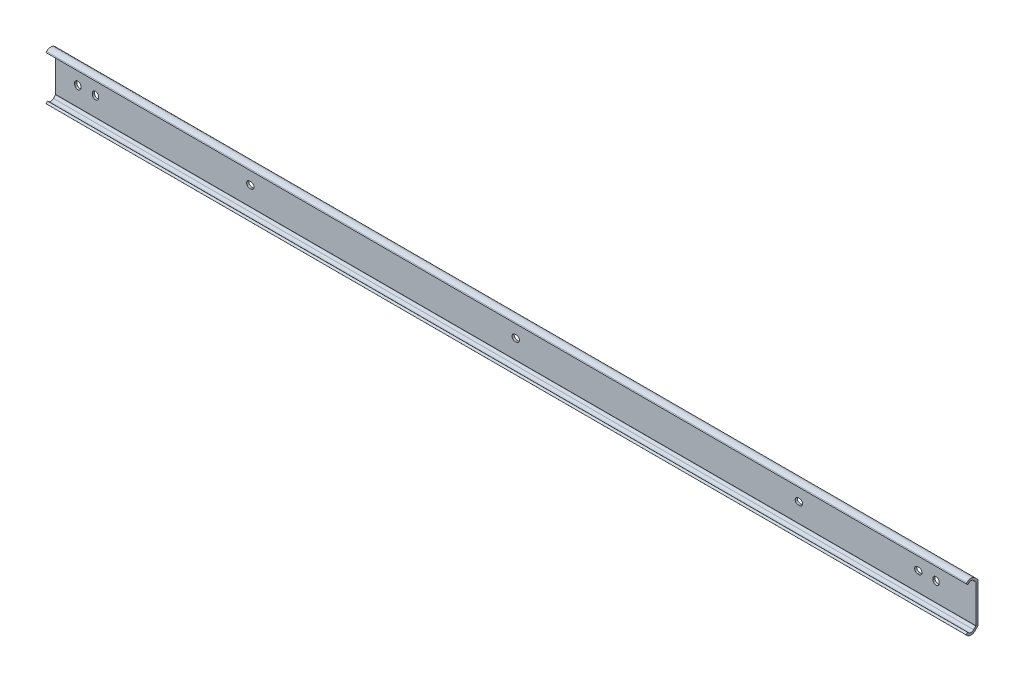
ISO-10303-21;
HEADER;
FILE_DESCRIPTION(('STEP AP214'),'2;1');
FILE_NAME('part.step','',(''),(''),'','','');
FILE_SCHEMA(('AUTOMOTIVE_DESIGN { 1 0 10303 214 1 1 1 1 }'));
ENDSEC;
DATA;
#1=APPLICATION_CONTEXT('core data for automotive mechanical design processes');
#2=APPLICATION_PROTOCOL_DEFINITION('international standard','automotive_design',2000,#1);
#3=PRODUCT_CONTEXT('',#1,'mechanical');
#4=PRODUCT('Part','Part','',(#3));
#5=PRODUCT_RELATED_PRODUCT_CATEGORY('part','',(#4));
#6=PRODUCT_DEFINITION_FORMATION('','',#4);
#7=PRODUCT_DEFINITION_CONTEXT('part definition',#1,'design');
#8=PRODUCT_DEFINITION('design','',#6,#7);
#9=PRODUCT_DEFINITION_SHAPE('','',#8);
#10=(LENGTH_UNIT() NAMED_UNIT(*) SI_UNIT(.MILLI.,.METRE.));
#11=(NAMED_UNIT(*) PLANE_ANGLE_UNIT() SI_UNIT($,.RADIAN.));
#12=(NAMED_UNIT(*) SI_UNIT($,.STERADIAN.) SOLID_ANGLE_UNIT());
#13=UNCERTAINTY_MEASURE_WITH_UNIT(LENGTH_MEASURE(1.E-05),#10,'distance_accuracy_value','');
#14=(GEOMETRIC_REPRESENTATION_CONTEXT(3) GLOBAL_UNCERTAINTY_ASSIGNED_CONTEXT((#13)) GLOBAL_UNIT_ASSIGNED_CONTEXT((#10,
#11,#12)) REPRESENTATION_CONTEXT('',''));
#15=CARTESIAN_POINT('',(0.,0.,0.));
#16=DIRECTION('',(0.,0.,1.));
#17=DIRECTION('',(1.,0.,0.));
#18=AXIS2_PLACEMENT_3D('',#15,#16,#17);
#19=CARTESIAN_POINT('',(644.5,-13.5749999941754,5.00000035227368));
#20=DIRECTION('',(-1.,0.,0.));
#21=DIRECTION('',(0.,0.,-1.));
#22=AXIS2_PLACEMENT_3D('',#19,#20,#21);
#23=CYLINDRICAL_SURFACE('',#22,2.55);
#24=CARTESIAN_POINT('',(-15.9,-13.5749999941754,5.00000035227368));
#25=DIRECTION('',(-1.,0.,0.));
#26=DIRECTION('',(0.,0.,1.));
#27=AXIS2_PLACEMENT_3D('',#24,#25,#26);
#28=CIRCLE('',#27,2.55);
#29=CARTESIAN_POINT('',(-15.9,-15.2920516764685,3.11473285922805));
#30=VERTEX_POINT('',#29);
#31=CARTESIAN_POINT('',(-15.9,-15.2920937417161,6.88522953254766));
#32=VERTEX_POINT('',#31);
#33=EDGE_CURVE('E541',#30,#32,#28,.T.);
#34=ORIENTED_EDGE('',*,*,#33,.T.);
#35=DIRECTION('',(-1.,0.,0.));
#36=VECTOR('',#35,1.);
#37=CARTESIAN_POINT('',(644.5,-15.2920937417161,6.88522953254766));
#38=LINE('',#37,#36);
#39=CARTESIAN_POINT('',(644.5,-15.2920937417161,6.88522953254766));
#40=VERTEX_POINT('',#39);
#41=EDGE_CURVE('E9',#40,#32,#38,.T.);
#42=ORIENTED_EDGE('',*,*,#41,.F.);
#43=CARTESIAN_POINT('',(644.5,-13.5749999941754,5.00000035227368));
#44=DIRECTION('',(-1.,0.,0.));
#45=DIRECTION('',(0.,0.,1.));
#46=AXIS2_PLACEMENT_3D('',#43,#44,#45);
#47=CIRCLE('',#46,2.55);
#48=CARTESIAN_POINT('',(644.5,-15.2920516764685,3.11473285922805));
#49=VERTEX_POINT('',#48);
#50=EDGE_CURVE('E588',#49,#40,#47,.T.);
#51=ORIENTED_EDGE('',*,*,#50,.F.);
#52=DIRECTION('',(-1.,0.,0.));
#53=VECTOR('',#52,1.);
#54=CARTESIAN_POINT('',(644.5,-15.2920516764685,3.11473285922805));
#55=LINE('',#54,#53);
#56=EDGE_CURVE('E629',#49,#30,#55,.T.);
#57=ORIENTED_EDGE('',*,*,#56,.T.);
#58=EDGE_LOOP('',(#34,#42,#51,#57));
#59=FACE_BOUND('',#58,.T.);
#60=ADVANCED_FACE('F14',(#59),#23,.F.);
#61=CARTESIAN_POINT('',(644.5,-15.2920937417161,6.88522953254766));
#62=DIRECTION('',(0.,-0.692409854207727,0.721504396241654));
#63=DIRECTION('',(0.,-0.721504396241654,-0.692409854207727));
#64=AXIS2_PLACEMENT_3D('',#61,#62,#63);
#65=PLANE('',#64);
#66=DIRECTION('',(0.,0.721504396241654,0.692409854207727));
#67=VECTOR('',#66,1.);
#68=CARTESIAN_POINT('',(-15.9,-15.2920937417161,6.88522953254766));
#69=LINE('',#68,#67);
#70=CARTESIAN_POINT('',(-15.9,-14.7934623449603,7.36375370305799));
#71=VERTEX_POINT('',#70);
#72=EDGE_CURVE('E550',#32,#71,#69,.T.);
#73=ORIENTED_EDGE('',*,*,#72,.T.);
#74=DIRECTION('',(-1.,0.,0.));
#75=VECTOR('',#74,1.);
#76=CARTESIAN_POINT('',(644.5,-14.7934623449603,7.36375370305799));
#77=LINE('',#76,#75);
#78=CARTESIAN_POINT('',(644.5,-14.7934623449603,7.36375370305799));
#79=VERTEX_POINT('',#78);
#80=EDGE_CURVE('E21',#79,#71,#77,.T.);
#81=ORIENTED_EDGE('',*,*,#80,.F.);
#82=DIRECTION('',(0.,0.721504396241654,0.692409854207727));
#83=VECTOR('',#82,1.);
#84=CARTESIAN_POINT('',(644.5,-15.2920937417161,6.88522953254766));
#85=LINE('',#84,#83);
#86=EDGE_CURVE('E591',#40,#79,#85,.T.);
#87=ORIENTED_EDGE('',*,*,#86,.F.);
#88=ORIENTED_EDGE('',*,*,#41,.T.);
#89=EDGE_LOOP('',(#73,#81,#87,#88));
#90=FACE_BOUND('',#89,.T.);
#91=ADVANCED_FACE('F711',(#90),#65,.F.);
#92=CARTESIAN_POINT('',(644.5,-14.7934623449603,7.36375370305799));
#93=DIRECTION('',(0.,-0.707106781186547,-0.707106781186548));
#94=DIRECTION('',(0.,0.707106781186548,-0.707106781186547));
#95=AXIS2_PLACEMENT_3D('',#92,#93,#94);
#96=PLANE('',#95);
#97=DIRECTION('',(0.,-0.707106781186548,0.707106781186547));
#98=VECTOR('',#97,1.);
#99=CARTESIAN_POINT('',(-15.9,-14.7934623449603,7.36375370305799));
#100=LINE('',#99,#98);
#101=CARTESIAN_POINT('',(-15.9,-15.8897093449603,8.46000070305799));
#102=VERTEX_POINT('',#101);
#103=EDGE_CURVE('E552',#71,#102,#100,.T.);
#104=ORIENTED_EDGE('',*,*,#103,.T.);
#105=DIRECTION('',(-1.,0.,0.));
#106=VECTOR('',#105,1.);
#107=CARTESIAN_POINT('',(644.5,-15.8897093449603,8.46000070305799));
#108=LINE('',#107,#106);
#109=CARTESIAN_POINT('',(644.5,-15.8897093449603,8.46000070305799));
#110=VERTEX_POINT('',#109);
#111=EDGE_CURVE('E680',#110,#102,#108,.T.);
#112=ORIENTED_EDGE('',*,*,#111,.F.);
#113=DIRECTION('',(0.,-0.707106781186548,0.707106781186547));
#114=VECTOR('',#113,1.);
#115=CARTESIAN_POINT('',(644.5,-14.7934623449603,7.36375370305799));
#116=LINE('',#115,#114);
#117=EDGE_CURVE('E593',#79,#110,#116,.T.);
#118=ORIENTED_EDGE('',*,*,#117,.F.);
#119=ORIENTED_EDGE('',*,*,#80,.T.);
#120=EDGE_LOOP('',(#104,#112,#118,#119));
#121=FACE_BOUND('',#120,.T.);
#122=ADVANCED_FACE('F687',(#121),#96,.F.);
#123=CARTESIAN_POINT('',(644.5,-16.3524236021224,8.01594474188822));
#124=DIRECTION('',(0.,0.692410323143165,-0.721503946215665));
#125=DIRECTION('',(0.,0.721503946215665,0.692410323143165));
#126=AXIS2_PLACEMENT_3D('',#123,#124,#125);
#127=PLANE('',#126);
#128=DIRECTION('',(0.,-0.721503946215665,-0.692410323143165));
#129=VECTOR('',#128,1.);
#130=CARTESIAN_POINT('',(-15.9,-16.3524236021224,8.01594474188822));
#131=LINE('',#130,#129);
#132=CARTESIAN_POINT('',(-15.9,-16.3524236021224,8.01594474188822));
#133=VERTEX_POINT('',#132);
#134=EDGE_CURVE('E554',#102,#133,#131,.T.);
#135=ORIENTED_EDGE('',*,*,#134,.T.);
#136=DIRECTION('',(-1.,0.,0.));
#137=VECTOR('',#136,1.);
#138=CARTESIAN_POINT('',(644.5,-16.3524236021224,8.01594474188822));
#139=LINE('',#138,#137);
#140=CARTESIAN_POINT('',(644.5,-16.3524236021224,8.01594474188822));
#141=VERTEX_POINT('',#140);
#142=EDGE_CURVE('E677',#141,#133,#139,.T.);
#143=ORIENTED_EDGE('',*,*,#142,.F.);
#144=DIRECTION('',(0.,-0.721503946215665,-0.692410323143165));
#145=VECTOR('',#144,1.);
#146=CARTESIAN_POINT('',(644.5,-16.3524236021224,8.01594474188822));
#147=LINE('',#146,#145);
#148=EDGE_CURVE('E595',#110,#141,#147,.T.);
#149=ORIENTED_EDGE('',*,*,#148,.F.);
#150=ORIENTED_EDGE('',*,*,#111,.T.);
#151=EDGE_LOOP('',(#135,#143,#149,#150));
#152=FACE_BOUND('',#151,.T.);
#153=ADVANCED_FACE('F699',(#152),#127,.F.);
#154=CARTESIAN_POINT('',(644.5,-13.5749999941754,5.00000035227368));
#155=DIRECTION('',(-1.,0.,0.));
#156=DIRECTION('',(0.,0.,-1.));
#157=AXIS2_PLACEMENT_3D('',#154,#155,#156);
#158=CYLINDRICAL_SURFACE('',#157,4.10000029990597);
#159=CARTESIAN_POINT('',(-15.9,-13.5749999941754,5.00000035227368));
#160=DIRECTION('',(1.,0.,0.));
#161=DIRECTION('',(0.,0.,1.));
#162=AXIS2_PLACEMENT_3D('',#159,#160,#161);
#163=CIRCLE('',#162,4.10000029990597);
#164=CARTESIAN_POINT('',(-15.9,-16.4741380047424,2.10086233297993));
#165=VERTEX_POINT('',#164);
#166=EDGE_CURVE('E556',#133,#165,#163,.T.);
#167=ORIENTED_EDGE('',*,*,#166,.T.);
#168=DIRECTION('',(-1.,0.,0.));
#169=VECTOR('',#168,1.);
#170=CARTESIAN_POINT('',(644.5,-16.4741380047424,2.10086233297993));
#171=LINE('',#170,#169);
#172=CARTESIAN_POINT('',(644.5,-16.4741380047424,2.10086233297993));
#173=VERTEX_POINT('',#172);
#174=EDGE_CURVE('E674',#173,#165,#171,.T.);
#175=ORIENTED_EDGE('',*,*,#174,.F.);
#176=CARTESIAN_POINT('',(644.5,-13.5749999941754,5.00000035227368));
#177=DIRECTION('',(1.,0.,0.));
#178=DIRECTION('',(0.,0.,1.));
#179=AXIS2_PLACEMENT_3D('',#176,#177,#178);
#180=CIRCLE('',#179,4.10000029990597);
#181=EDGE_CURVE('E597',#141,#173,#180,.T.);
#182=ORIENTED_EDGE('',*,*,#181,.F.);
#183=ORIENTED_EDGE('',*,*,#142,.T.);
#184=EDGE_LOOP('',(#167,#175,#182,#183));
#185=FACE_BOUND('',#184,.T.);
#186=ADVANCED_FACE('F703',(#185),#158,.T.);
#187=CARTESIAN_POINT('',(644.5,-16.4741380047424,2.10086233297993));
#188=DIRECTION('',(0.,0.692410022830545,0.721504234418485));
#189=DIRECTION('',(0.,-0.721504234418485,0.692410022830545));
#190=AXIS2_PLACEMENT_3D('',#187,#188,#189);
#191=PLANE('',#190);
#192=DIRECTION('',(0.,0.721504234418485,-0.692410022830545));
#193=VECTOR('',#192,1.);
#194=CARTESIAN_POINT('',(-15.9,-16.4741380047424,2.10086233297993));
#195=LINE('',#194,#193);
#196=CARTESIAN_POINT('',(-15.9,-14.8073561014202,0.501292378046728));
#197=VERTEX_POINT('',#196);
#198=EDGE_CURVE('E558',#165,#197,#195,.T.);
#199=ORIENTED_EDGE('',*,*,#198,.T.);
#200=DIRECTION('',(-1.,0.,0.));
#201=VECTOR('',#200,1.);
#202=CARTESIAN_POINT('',(644.5,-14.8073561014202,0.501292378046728));
#203=LINE('',#202,#201);
#204=CARTESIAN_POINT('',(644.5,-14.8073561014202,0.501292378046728));
#205=VERTEX_POINT('',#204);
#206=EDGE_CURVE('E671',#205,#197,#203,.T.);
#207=ORIENTED_EDGE('',*,*,#206,.F.);
#208=DIRECTION('',(0.,0.721504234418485,-0.692410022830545));
#209=VECTOR('',#208,1.);
#210=CARTESIAN_POINT('',(644.5,-16.4741380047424,2.10086233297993));
#211=LINE('',#210,#209);
#212=EDGE_CURVE('E599',#173,#205,#211,.T.);
#213=ORIENTED_EDGE('',*,*,#212,.F.);
#214=ORIENTED_EDGE('',*,*,#174,.T.);
#215=EDGE_LOOP('',(#199,#207,#213,#214));
#216=FACE_BOUND('',#215,.T.);
#217=ADVANCED_FACE('F782',(#216),#191,.F.);
#218=CARTESIAN_POINT('',(644.5,-13.5610180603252,1.8));
#219=DIRECTION('',(-1.,0.,0.));
#220=DIRECTION('',(0.,0.,-1.));
#221=AXIS2_PLACEMENT_3D('',#218,#219,#220);
#222=CYLINDRICAL_SURFACE('',#221,1.8);
#223=CARTESIAN_POINT('',(-15.9,-13.5610180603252,1.8));
#224=DIRECTION('',(1.,0.,0.));
#225=DIRECTION('',(0.,0.,1.));
#226=AXIS2_PLACEMENT_3D('',#223,#224,#225);
#227=CIRCLE('',#226,1.8);
#228=CARTESIAN_POINT('',(-15.9,-13.5610180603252,0.));
#229=VERTEX_POINT('',#228);
#230=EDGE_CURVE('E560',#197,#229,#227,.T.);
#231=ORIENTED_EDGE('',*,*,#230,.T.);
#232=DIRECTION('',(-1.,0.,0.));
#233=VECTOR('',#232,1.);
#234=CARTESIAN_POINT('',(644.5,-13.5610180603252,0.));
#235=LINE('',#234,#233);
#236=CARTESIAN_POINT('',(644.5,-13.5610180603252,0.));
#237=VERTEX_POINT('',#236);
#238=EDGE_CURVE('E668',#237,#229,#235,.T.);
#239=ORIENTED_EDGE('',*,*,#238,.F.);
#240=CARTESIAN_POINT('',(644.5,-13.5610180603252,1.8));
#241=DIRECTION('',(1.,0.,0.));
#242=DIRECTION('',(0.,0.,1.));
#243=AXIS2_PLACEMENT_3D('',#240,#241,#242);
#244=CIRCLE('',#243,1.8);
#245=EDGE_CURVE('E601',#205,#237,#244,.T.);
#246=ORIENTED_EDGE('',*,*,#245,.F.);
#247=ORIENTED_EDGE('',*,*,#206,.T.);
#248=EDGE_LOOP('',(#231,#239,#246,#247));
#249=FACE_BOUND('',#248,.T.);
#250=ADVANCED_FACE('F780',(#249),#222,.T.);
#251=CARTESIAN_POINT('',(644.5,13.5610180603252,0.));
#252=DIRECTION('',(0.,0.,1.));
#253=DIRECTION('',(-1.,0.,0.));
#254=AXIS2_PLACEMENT_3D('',#251,#252,#253);
#255=PLANE('',#254);
#256=DIRECTION('',(1.,0.,0.));
#257=VECTOR('',#256,1.);
#258=CARTESIAN_POINT('',(644.5,-2.25,0.));
#259=LINE('',#258,#257);
#260=CARTESIAN_POINT('',(313.9,-2.25,0.));
#261=VERTEX_POINT('',#260);
#262=CARTESIAN_POINT('',(314.7,-2.25,0.));
#263=VERTEX_POINT('',#262);
#264=EDGE_CURVE('E349',#261,#263,#259,.T.);
#265=ORIENTED_EDGE('',*,*,#264,.T.);
#266=CARTESIAN_POINT('',(314.7,0.,0.));
#267=DIRECTION('',(0.,0.,1.));
#268=DIRECTION('',(-1.,0.,0.));
#269=AXIS2_PLACEMENT_3D('',#266,#267,#268);
#270=CIRCLE('',#269,2.25);
#271=CARTESIAN_POINT('',(314.7,2.25,0.));
#272=VERTEX_POINT('',#271);
#273=EDGE_CURVE('E352',#263,#272,#270,.T.);
#274=ORIENTED_EDGE('',*,*,#273,.T.);
#275=DIRECTION('',(-1.,0.,0.));
#276=VECTOR('',#275,1.);
#277=CARTESIAN_POINT('',(644.5,2.25,0.));
#278=LINE('',#277,#276);
#279=CARTESIAN_POINT('',(313.9,2.25,0.));
#280=VERTEX_POINT('',#279);
#281=EDGE_CURVE('E344',#272,#280,#278,.T.);
#282=ORIENTED_EDGE('',*,*,#281,.T.);
#283=CARTESIAN_POINT('',(313.9,0.,0.));
#284=DIRECTION('',(0.,0.,1.));
#285=DIRECTION('',(-1.,0.,0.));
#286=AXIS2_PLACEMENT_3D('',#283,#284,#285);
#287=CIRCLE('',#286,2.25);
#288=EDGE_CURVE('E324',#280,#261,#287,.T.);
#289=ORIENTED_EDGE('',*,*,#288,.T.);
#290=EDGE_LOOP('',(#265,#274,#282,#289));
#291=FACE_BOUND('',#290,.T.);
#292=DIRECTION('',(0.,1.,0.));
#293=VECTOR('',#292,1.);
#294=CARTESIAN_POINT('',(14.9499999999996,-0.399999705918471,0.));
#295=LINE('',#294,#293);
#296=CARTESIAN_POINT('',(14.9499999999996,-0.399999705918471,0.));
#297=VERTEX_POINT('',#296);
#298=CARTESIAN_POINT('',(14.9499999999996,0.400000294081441,0.));
#299=VERTEX_POINT('',#298);
#300=EDGE_CURVE('E375',#297,#299,#295,.T.);
#301=ORIENTED_EDGE('',*,*,#300,.T.);
#302=CARTESIAN_POINT('',(12.7,0.400000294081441,0.));
#303=DIRECTION('',(0.,0.,1.));
#304=DIRECTION('',(-1.,0.,0.));
#305=AXIS2_PLACEMENT_3D('',#302,#303,#304);
#306=CIRCLE('',#305,2.24999999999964);
#307=CARTESIAN_POINT('',(10.45,0.400000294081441,0.));
#308=VERTEX_POINT('',#307);
#309=EDGE_CURVE('E366',#299,#308,#306,.T.);
#310=ORIENTED_EDGE('',*,*,#309,.T.);
#311=DIRECTION('',(0.,-1.,0.));
#312=VECTOR('',#311,1.);
#313=CARTESIAN_POINT('',(10.45,-0.399999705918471,0.));
#314=LINE('',#313,#312);
#315=CARTESIAN_POINT('',(10.45,-0.399999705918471,0.));
#316=VERTEX_POINT('',#315);
#317=EDGE_CURVE('E369',#308,#316,#314,.T.);
#318=ORIENTED_EDGE('',*,*,#317,.T.);
#319=CARTESIAN_POINT('',(12.7,-0.399999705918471,0.));
#320=DIRECTION('',(0.,0.,1.));
#321=DIRECTION('',(-1.,0.,0.));
#322=AXIS2_PLACEMENT_3D('',#319,#320,#321);
#323=CIRCLE('',#322,2.24999999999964);
#324=EDGE_CURVE('E372',#316,#297,#323,.T.);
#325=ORIENTED_EDGE('',*,*,#324,.T.);
#326=EDGE_LOOP('',(#301,#310,#318,#325));
#327=FACE_BOUND('',#326,.T.);
#328=DIRECTION('',(0.,-1.,0.));
#329=VECTOR('',#328,1.);
#330=CARTESIAN_POINT('',(-2.24999999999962,-0.399999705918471,0.));
#331=LINE('',#330,#329);
#332=CARTESIAN_POINT('',(-2.24999999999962,0.400000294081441,0.));
#333=VERTEX_POINT('',#332);
#334=CARTESIAN_POINT('',(-2.24999999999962,-0.399999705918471,0.));
#335=VERTEX_POINT('',#334);
#336=EDGE_CURVE('E407',#333,#335,#331,.T.);
#337=ORIENTED_EDGE('',*,*,#336,.T.);
#338=CARTESIAN_POINT('',(0.,-0.399999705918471,0.));
#339=DIRECTION('',(0.,0.,1.));
#340=DIRECTION('',(-1.,0.,0.));
#341=AXIS2_PLACEMENT_3D('',#338,#339,#340);
#342=CIRCLE('',#341,2.24999999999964);
#343=CARTESIAN_POINT('',(2.24999999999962,-0.399999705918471,0.));
#344=VERTEX_POINT('',#343);
#345=EDGE_CURVE('E398',#335,#344,#342,.T.);
#346=ORIENTED_EDGE('',*,*,#345,.T.);
#347=DIRECTION('',(0.,1.,0.));
#348=VECTOR('',#347,1.);
#349=CARTESIAN_POINT('',(2.24999999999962,-0.399999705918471,0.));
#350=LINE('',#349,#348);
#351=CARTESIAN_POINT('',(2.24999999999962,0.400000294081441,0.));
#352=VERTEX_POINT('',#351);
#353=EDGE_CURVE('E401',#344,#352,#350,.T.);
#354=ORIENTED_EDGE('',*,*,#353,.T.);
#355=CARTESIAN_POINT('',(0.,0.400000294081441,0.));
#356=DIRECTION('',(0.,0.,1.));
#357=DIRECTION('',(-1.,0.,0.));
#358=AXIS2_PLACEMENT_3D('',#355,#356,#357);
#359=CIRCLE('',#358,2.24999999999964);
#360=EDGE_CURVE('E404',#352,#333,#359,.T.);
#361=ORIENTED_EDGE('',*,*,#360,.T.);
#362=EDGE_LOOP('',(#337,#346,#354,#361));
#363=FACE_BOUND('',#362,.T.);
#364=DIRECTION('',(1.,-1.05167610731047E-13,0.));
#365=VECTOR('',#364,1.);
#366=CARTESIAN_POINT('',(517.9,-2.24999970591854,0.));
#367=LINE('',#366,#365);
#368=CARTESIAN_POINT('',(517.1,-2.24999970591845,0.));
#369=VERTEX_POINT('',#368);
#370=CARTESIAN_POINT('',(517.9,-2.24999970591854,0.));
#371=VERTEX_POINT('',#370);
#372=EDGE_CURVE('E439',#369,#371,#367,.T.);
#373=ORIENTED_EDGE('',*,*,#372,.T.);
#374=CARTESIAN_POINT('',(517.9,2.94081439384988E-07,0.));
#375=DIRECTION('',(0.,0.,1.));
#376=DIRECTION('',(-1.,0.,0.));
#377=AXIS2_PLACEMENT_3D('',#374,#375,#376);
#378=CIRCLE('',#377,2.24999999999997);
#379=CARTESIAN_POINT('',(517.9,2.25000029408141,0.));
#380=VERTEX_POINT('',#379);
#381=EDGE_CURVE('E430',#371,#380,#378,.T.);
#382=ORIENTED_EDGE('',*,*,#381,.T.);
#383=DIRECTION('',(-1.,0.,0.));
#384=VECTOR('',#383,1.);
#385=CARTESIAN_POINT('',(517.9,2.25000029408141,0.));
#386=LINE('',#385,#384);
#387=CARTESIAN_POINT('',(517.1,2.25000029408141,0.));
#388=VERTEX_POINT('',#387);
#389=EDGE_CURVE('E433',#380,#388,#386,.T.);
#390=ORIENTED_EDGE('',*,*,#389,.T.);
#391=CARTESIAN_POINT('',(517.1,2.94081481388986E-07,0.));
#392=DIRECTION('',(0.,0.,1.));
#393=DIRECTION('',(-1.,0.,0.));
#394=AXIS2_PLACEMENT_3D('',#391,#392,#393);
#395=CIRCLE('',#394,2.24999999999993);
#396=EDGE_CURVE('E436',#388,#369,#395,.T.);
#397=ORIENTED_EDGE('',*,*,#396,.T.);
#398=EDGE_LOOP('',(#373,#382,#390,#397));
#399=FACE_BOUND('',#398,.T.);
#400=DIRECTION('',(1.,0.,0.));
#401=VECTOR('',#400,1.);
#402=CARTESIAN_POINT('',(603.6,-2.2499997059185,0.));
#403=LINE('',#402,#401);
#404=CARTESIAN_POINT('',(602.8,-2.24999970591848,0.));
#405=VERTEX_POINT('',#404);
#406=CARTESIAN_POINT('',(603.6,-2.2499997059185,0.));
#407=VERTEX_POINT('',#406);
#408=EDGE_CURVE('E471',#405,#407,#403,.T.);
#409=ORIENTED_EDGE('',*,*,#408,.T.);
#410=CARTESIAN_POINT('',(603.6,2.9408147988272E-07,0.));
#411=DIRECTION('',(0.,0.,1.));
#412=DIRECTION('',(-1.,0.,0.));
#413=AXIS2_PLACEMENT_3D('',#410,#411,#412);
#414=CIRCLE('',#413,2.24999999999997);
#415=CARTESIAN_POINT('',(603.6,2.25000029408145,0.));
#416=VERTEX_POINT('',#415);
#417=EDGE_CURVE('E462',#407,#416,#414,.T.);
#418=ORIENTED_EDGE('',*,*,#417,.T.);
#419=DIRECTION('',(-1.,0.,0.));
#420=VECTOR('',#419,1.);
#421=CARTESIAN_POINT('',(603.6,2.25000029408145,0.));
#422=LINE('',#421,#420);
#423=CARTESIAN_POINT('',(602.8,2.25000029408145,0.));
#424=VERTEX_POINT('',#423);
#425=EDGE_CURVE('E465',#416,#424,#422,.T.);
#426=ORIENTED_EDGE('',*,*,#425,.T.);
#427=CARTESIAN_POINT('',(602.8,2.94081484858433E-07,0.));
#428=DIRECTION('',(0.,0.,1.));
#429=DIRECTION('',(-1.,0.,0.));
#430=AXIS2_PLACEMENT_3D('',#427,#428,#429);
#431=CIRCLE('',#430,2.24999999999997);
#432=EDGE_CURVE('E468',#424,#405,#431,.T.);
#433=ORIENTED_EDGE('',*,*,#432,.T.);
#434=EDGE_LOOP('',(#409,#418,#426,#433));
#435=FACE_BOUND('',#434,.T.);
#436=DIRECTION('',(0.,1.,0.));
#437=VECTOR('',#436,1.);
#438=CARTESIAN_POINT('',(618.15,-0.399999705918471,0.));
#439=LINE('',#438,#437);
#440=CARTESIAN_POINT('',(618.15,-0.399999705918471,0.));
#441=VERTEX_POINT('',#440);
#442=CARTESIAN_POINT('',(618.15,0.400000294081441,0.));
#443=VERTEX_POINT('',#442);
#444=EDGE_CURVE('E503',#441,#443,#439,.T.);
#445=ORIENTED_EDGE('',*,*,#444,.T.);
#446=CARTESIAN_POINT('',(615.9,0.400000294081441,0.));
#447=DIRECTION('',(0.,0.,1.));
#448=DIRECTION('',(-1.,0.,0.));
#449=AXIS2_PLACEMENT_3D('',#446,#447,#448);
#450=CIRCLE('',#449,2.24999999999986);
#451=CARTESIAN_POINT('',(613.65,0.40000029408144,0.));
#452=VERTEX_POINT('',#451);
#453=EDGE_CURVE('E494',#443,#452,#450,.T.);
#454=ORIENTED_EDGE('',*,*,#453,.T.);
#455=DIRECTION('',(0.,-1.,0.));
#456=VECTOR('',#455,1.);
#457=CARTESIAN_POINT('',(613.65,-0.399999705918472,0.));
#458=LINE('',#457,#456);
#459=CARTESIAN_POINT('',(613.65,-0.399999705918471,0.));
#460=VERTEX_POINT('',#459);
#461=EDGE_CURVE('E497',#452,#460,#458,.T.);
#462=ORIENTED_EDGE('',*,*,#461,.T.);
#463=CARTESIAN_POINT('',(615.9,-0.399999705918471,0.));
#464=DIRECTION('',(0.,0.,1.));
#465=DIRECTION('',(-1.,0.,0.));
#466=AXIS2_PLACEMENT_3D('',#463,#464,#465);
#467=CIRCLE('',#466,2.24999999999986);
#468=EDGE_CURVE('E500',#460,#441,#467,.T.);
#469=ORIENTED_EDGE('',*,*,#468,.T.);
#470=EDGE_LOOP('',(#445,#454,#462,#469));
#471=FACE_BOUND('',#470,.T.);
#472=DIRECTION('',(1.,-1.91903784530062E-13,0.));
#473=VECTOR('',#472,1.);
#474=CARTESIAN_POINT('',(124.2,-2.24999797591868,0.));
#475=LINE('',#474,#473);
#476=CARTESIAN_POINT('',(123.4,-2.24999797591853,0.));
#477=VERTEX_POINT('',#476);
#478=CARTESIAN_POINT('',(124.2,-2.24999797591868,0.));
#479=VERTEX_POINT('',#478);
#480=EDGE_CURVE('E535',#477,#479,#475,.T.);
#481=ORIENTED_EDGE('',*,*,#480,.T.);
#482=CARTESIAN_POINT('',(124.2,2.02408129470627E-06,0.));
#483=DIRECTION('',(0.,0.,1.));
#484=DIRECTION('',(-1.,0.,0.));
#485=AXIS2_PLACEMENT_3D('',#482,#483,#484);
#486=CIRCLE('',#485,2.24999999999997);
#487=CARTESIAN_POINT('',(124.2,2.25000202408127,0.));
#488=VERTEX_POINT('',#487);
#489=EDGE_CURVE('E526',#479,#488,#486,.T.);
#490=ORIENTED_EDGE('',*,*,#489,.T.);
#491=DIRECTION('',(-1.,0.,0.));
#492=VECTOR('',#491,1.);
#493=CARTESIAN_POINT('',(124.2,2.25000202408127,0.));
#494=LINE('',#493,#492);
#495=CARTESIAN_POINT('',(123.4,2.25000202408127,0.));
#496=VERTEX_POINT('',#495);
#497=EDGE_CURVE('E529',#488,#496,#494,.T.);
#498=ORIENTED_EDGE('',*,*,#497,.T.);
#499=CARTESIAN_POINT('',(123.4,2.0240813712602E-06,0.));
#500=DIRECTION('',(0.,0.,1.));
#501=DIRECTION('',(-1.,0.,0.));
#502=AXIS2_PLACEMENT_3D('',#499,#500,#501);
#503=CIRCLE('',#502,2.2499999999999);
#504=EDGE_CURVE('E532',#496,#477,#503,.T.);
#505=ORIENTED_EDGE('',*,*,#504,.T.);
#506=EDGE_LOOP('',(#481,#490,#498,#505));
#507=FACE_BOUND('',#506,.T.);
#508=DIRECTION('',(0.,1.,0.));
#509=VECTOR('',#508,1.);
#510=CARTESIAN_POINT('',(-15.9,13.5610180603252,0.));
#511=LINE('',#510,#509);
#512=CARTESIAN_POINT('',(-15.9,13.5610180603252,0.));
#513=VERTEX_POINT('',#512);
#514=EDGE_CURVE('E562',#229,#513,#511,.T.);
#515=ORIENTED_EDGE('',*,*,#514,.T.);
#516=DIRECTION('',(-1.,0.,0.));
#517=VECTOR('',#516,1.);
#518=CARTESIAN_POINT('',(644.5,13.5610180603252,0.));
#519=LINE('',#518,#517);
#520=CARTESIAN_POINT('',(644.5,13.5610180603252,0.));
#521=VERTEX_POINT('',#520);
#522=EDGE_CURVE('E665',#521,#513,#519,.T.);
#523=ORIENTED_EDGE('',*,*,#522,.F.);
#524=DIRECTION('',(0.,1.,0.));
#525=VECTOR('',#524,1.);
#526=CARTESIAN_POINT('',(644.5,13.5610180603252,0.));
#527=LINE('',#526,#525);
#528=EDGE_CURVE('E603',#237,#521,#527,.T.);
#529=ORIENTED_EDGE('',*,*,#528,.F.);
#530=ORIENTED_EDGE('',*,*,#238,.T.);
#531=EDGE_LOOP('',(#515,#523,#529,#530));
#532=FACE_BOUND('',#531,.T.);
#533=ADVANCED_FACE('F775',(#291,#327,#363,#399,#435,#471,#507,#532),#255,.F.);
#534=CARTESIAN_POINT('',(644.5,13.5610180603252,1.8));
#535=DIRECTION('',(-1.,0.,0.));
#536=DIRECTION('',(0.,0.,-1.));
#537=AXIS2_PLACEMENT_3D('',#534,#535,#536);
#538=CYLINDRICAL_SURFACE('',#537,1.8);
#539=CARTESIAN_POINT('',(-15.9,13.5610180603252,1.8));
#540=DIRECTION('',(1.,0.,0.));
#541=DIRECTION('',(0.,0.,-1.));
#542=AXIS2_PLACEMENT_3D('',#539,#540,#541);
#543=CIRCLE('',#542,1.8);
#544=CARTESIAN_POINT('',(-15.9,14.8073561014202,0.501292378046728));
#545=VERTEX_POINT('',#544);
#546=EDGE_CURVE('E564',#513,#545,#543,.T.);
#547=ORIENTED_EDGE('',*,*,#546,.T.);
#548=DIRECTION('',(-1.,0.,0.));
#549=VECTOR('',#548,1.);
#550=CARTESIAN_POINT('',(644.5,14.8073561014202,0.501292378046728));
#551=LINE('',#550,#549);
#552=CARTESIAN_POINT('',(644.5,14.8073561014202,0.501292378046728));
#553=VERTEX_POINT('',#552);
#554=EDGE_CURVE('E662',#553,#545,#551,.T.);
#555=ORIENTED_EDGE('',*,*,#554,.F.);
#556=CARTESIAN_POINT('',(644.5,13.5610180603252,1.8));
#557=DIRECTION('',(1.,0.,0.));
#558=DIRECTION('',(0.,0.,-1.));
#559=AXIS2_PLACEMENT_3D('',#556,#557,#558);
#560=CIRCLE('',#559,1.8);
#561=EDGE_CURVE('E605',#521,#553,#560,.T.);
#562=ORIENTED_EDGE('',*,*,#561,.F.);
#563=ORIENTED_EDGE('',*,*,#522,.T.);
#564=EDGE_LOOP('',(#547,#555,#562,#563));
#565=FACE_BOUND('',#564,.T.);
#566=ADVANCED_FACE('F770',(#565),#538,.T.);
#567=CARTESIAN_POINT('',(644.5,16.4741380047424,2.10086233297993));
#568=DIRECTION('',(0.,-0.692410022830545,0.721504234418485));
#569=DIRECTION('',(0.,-0.721504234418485,-0.692410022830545));
#570=AXIS2_PLACEMENT_3D('',#567,#568,#569);
#571=PLANE('',#570);
#572=DIRECTION('',(0.,0.721504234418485,0.692410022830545));
#573=VECTOR('',#572,1.);
#574=CARTESIAN_POINT('',(-15.9,16.4741380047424,2.10086233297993));
#575=LINE('',#574,#573);
#576=CARTESIAN_POINT('',(-15.9,16.4741380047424,2.10086233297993));
#577=VERTEX_POINT('',#576);
#578=EDGE_CURVE('E566',#545,#577,#575,.T.);
#579=ORIENTED_EDGE('',*,*,#578,.T.);
#580=DIRECTION('',(-1.,0.,0.));
#581=VECTOR('',#580,1.);
#582=CARTESIAN_POINT('',(644.5,16.4741380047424,2.10086233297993));
#583=LINE('',#582,#581);
#584=CARTESIAN_POINT('',(644.5,16.4741380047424,2.10086233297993));
#585=VERTEX_POINT('',#584);
#586=EDGE_CURVE('E659',#585,#577,#583,.T.);
#587=ORIENTED_EDGE('',*,*,#586,.F.);
#588=DIRECTION('',(0.,0.721504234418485,0.692410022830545));
#589=VECTOR('',#588,1.);
#590=CARTESIAN_POINT('',(644.5,16.4741380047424,2.10086233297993));
#591=LINE('',#590,#589);
#592=EDGE_CURVE('E607',#553,#585,#591,.T.);
#593=ORIENTED_EDGE('',*,*,#592,.F.);
#594=ORIENTED_EDGE('',*,*,#554,.T.);
#595=EDGE_LOOP('',(#579,#587,#593,#594));
#596=FACE_BOUND('',#595,.T.);
#597=ADVANCED_FACE('F766',(#596),#571,.F.);
#598=CARTESIAN_POINT('',(644.5,13.5749999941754,5.00000035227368));
#599=DIRECTION('',(-1.,0.,0.));
#600=DIRECTION('',(0.,0.,-1.));
#601=AXIS2_PLACEMENT_3D('',#598,#599,#600);
#602=CYLINDRICAL_SURFACE('',#601,4.10000029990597);
#603=CARTESIAN_POINT('',(-15.9,13.5749999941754,5.00000035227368));
#604=DIRECTION('',(1.,0.,0.));
#605=DIRECTION('',(0.,0.,-1.));
#606=AXIS2_PLACEMENT_3D('',#603,#604,#605);
#607=CIRCLE('',#606,4.10000029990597);
#608=CARTESIAN_POINT('',(-15.9,16.3524236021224,8.01594474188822));
#609=VERTEX_POINT('',#608);
#610=EDGE_CURVE('E568',#577,#609,#607,.T.);
#611=ORIENTED_EDGE('',*,*,#610,.T.);
#612=DIRECTION('',(-1.,0.,0.));
#613=VECTOR('',#612,1.);
#614=CARTESIAN_POINT('',(644.5,16.3524236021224,8.01594474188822));
#615=LINE('',#614,#613);
#616=CARTESIAN_POINT('',(644.5,16.3524236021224,8.01594474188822));
#617=VERTEX_POINT('',#616);
#618=EDGE_CURVE('E656',#617,#609,#615,.T.);
#619=ORIENTED_EDGE('',*,*,#618,.F.);
#620=CARTESIAN_POINT('',(644.5,13.5749999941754,5.00000035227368));
#621=DIRECTION('',(1.,0.,0.));
#622=DIRECTION('',(0.,0.,-1.));
#623=AXIS2_PLACEMENT_3D('',#620,#621,#622);
#624=CIRCLE('',#623,4.10000029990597);
#625=EDGE_CURVE('E609',#585,#617,#624,.T.);
#626=ORIENTED_EDGE('',*,*,#625,.F.);
#627=ORIENTED_EDGE('',*,*,#586,.T.);
#628=EDGE_LOOP('',(#611,#619,#626,#627));
#629=FACE_BOUND('',#628,.T.);
#630=ADVANCED_FACE('F761',(#629),#602,.T.);
#631=CARTESIAN_POINT('',(644.5,16.3524236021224,8.01594474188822));
#632=DIRECTION('',(0.,-0.692410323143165,-0.721503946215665));
#633=DIRECTION('',(0.,0.721503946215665,-0.692410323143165));
#634=AXIS2_PLACEMENT_3D('',#631,#632,#633);
#635=PLANE('',#634);
#636=DIRECTION('',(0.,-0.721503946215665,0.692410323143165));
#637=VECTOR('',#636,1.);
#638=CARTESIAN_POINT('',(-15.9,16.3524236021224,8.01594474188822));
#639=LINE('',#638,#637);
#640=CARTESIAN_POINT('',(-15.9,15.8897093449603,8.46000070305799));
#641=VERTEX_POINT('',#640);
#642=EDGE_CURVE('E570',#609,#641,#639,.T.);
#643=ORIENTED_EDGE('',*,*,#642,.T.);
#644=DIRECTION('',(-1.,0.,0.));
#645=VECTOR('',#644,1.);
#646=CARTESIAN_POINT('',(644.5,15.8897093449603,8.46000070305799));
#647=LINE('',#646,#645);
#648=CARTESIAN_POINT('',(644.5,15.8897093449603,8.46000070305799));
#649=VERTEX_POINT('',#648);
#650=EDGE_CURVE('E653',#649,#641,#647,.T.);
#651=ORIENTED_EDGE('',*,*,#650,.F.);
#652=DIRECTION('',(0.,-0.721503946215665,0.692410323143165));
#653=VECTOR('',#652,1.);
#654=CARTESIAN_POINT('',(644.5,16.3524236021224,8.01594474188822));
#655=LINE('',#654,#653);
#656=EDGE_CURVE('E611',#617,#649,#655,.T.);
#657=ORIENTED_EDGE('',*,*,#656,.F.);
#658=ORIENTED_EDGE('',*,*,#618,.T.);
#659=EDGE_LOOP('',(#643,#651,#657,#658));
#660=FACE_BOUND('',#659,.T.);
#661=ADVANCED_FACE('F755',(#660),#635,.F.);
#662=CARTESIAN_POINT('',(644.5,14.7934623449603,7.36375370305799));
#663=DIRECTION('',(0.,0.707106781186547,-0.707106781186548));
#664=DIRECTION('',(0.,0.707106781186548,0.707106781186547));
#665=AXIS2_PLACEMENT_3D('',#662,#663,#664);
#666=PLANE('',#665);
#667=DIRECTION('',(0.,-0.707106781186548,-0.707106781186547));
#668=VECTOR('',#667,1.);
#669=CARTESIAN_POINT('',(-15.9,14.7934623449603,7.36375370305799));
#670=LINE('',#669,#668);
#671=CARTESIAN_POINT('',(-15.9,14.7934623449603,7.36375370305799));
#672=VERTEX_POINT('',#671);
#673=EDGE_CURVE('E572',#641,#672,#670,.T.);
#674=ORIENTED_EDGE('',*,*,#673,.T.);
#675=DIRECTION('',(-1.,0.,0.));
#676=VECTOR('',#675,1.);
#677=CARTESIAN_POINT('',(644.5,14.7934623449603,7.36375370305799));
#678=LINE('',#677,#676);
#679=CARTESIAN_POINT('',(644.5,14.7934623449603,7.36375370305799));
#680=VERTEX_POINT('',#679);
#681=EDGE_CURVE('E650',#680,#672,#678,.T.);
#682=ORIENTED_EDGE('',*,*,#681,.F.);
#683=DIRECTION('',(0.,-0.707106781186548,-0.707106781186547));
#684=VECTOR('',#683,1.);
#685=CARTESIAN_POINT('',(644.5,14.7934623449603,7.36375370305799));
#686=LINE('',#685,#684);
#687=EDGE_CURVE('E613',#649,#680,#686,.T.);
#688=ORIENTED_EDGE('',*,*,#687,.F.);
#689=ORIENTED_EDGE('',*,*,#650,.T.);
#690=EDGE_LOOP('',(#674,#682,#688,#689));
#691=FACE_BOUND('',#690,.T.);
#692=ADVANCED_FACE('F751',(#691),#666,.F.);
#693=CARTESIAN_POINT('',(644.5,15.2920937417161,6.88522953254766));
#694=DIRECTION('',(0.,0.692409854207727,0.721504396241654));
#695=DIRECTION('',(0.,-0.721504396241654,0.692409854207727));
#696=AXIS2_PLACEMENT_3D('',#693,#694,#695);
#697=PLANE('',#696);
#698=DIRECTION('',(0.,0.721504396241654,-0.692409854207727));
#699=VECTOR('',#698,1.);
#700=CARTESIAN_POINT('',(-15.9,15.2920937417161,6.88522953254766));
#701=LINE('',#700,#699);
#702=CARTESIAN_POINT('',(-15.9,15.2920937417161,6.88522953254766));
#703=VERTEX_POINT('',#702);
#704=EDGE_CURVE('E574',#672,#703,#701,.T.);
#705=ORIENTED_EDGE('',*,*,#704,.T.);
#706=DIRECTION('',(-1.,0.,0.));
#707=VECTOR('',#706,1.);
#708=CARTESIAN_POINT('',(644.5,15.2920937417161,6.88522953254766));
#709=LINE('',#708,#707);
#710=CARTESIAN_POINT('',(644.5,15.2920937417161,6.88522953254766));
#711=VERTEX_POINT('',#710);
#712=EDGE_CURVE('E647',#711,#703,#709,.T.);
#713=ORIENTED_EDGE('',*,*,#712,.F.);
#714=DIRECTION('',(0.,0.721504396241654,-0.692409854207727));
#715=VECTOR('',#714,1.);
#716=CARTESIAN_POINT('',(644.5,15.2920937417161,6.88522953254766));
#717=LINE('',#716,#715);
#718=EDGE_CURVE('E615',#680,#711,#717,.T.);
#719=ORIENTED_EDGE('',*,*,#718,.F.);
#720=ORIENTED_EDGE('',*,*,#681,.T.);
#721=EDGE_LOOP('',(#705,#713,#719,#720));
#722=FACE_BOUND('',#721,.T.);
#723=ADVANCED_FACE('F746',(#722),#697,.F.);
#724=CARTESIAN_POINT('',(644.5,13.5749999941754,5.00000035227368));
#725=DIRECTION('',(-1.,0.,0.));
#726=DIRECTION('',(0.,0.,-1.));
#727=AXIS2_PLACEMENT_3D('',#724,#725,#726);
#728=CYLINDRICAL_SURFACE('',#727,2.55);
#729=CARTESIAN_POINT('',(-15.9,13.5749999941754,5.00000035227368));
#730=DIRECTION('',(-1.,0.,0.));
#731=DIRECTION('',(0.,0.,-1.));
#732=AXIS2_PLACEMENT_3D('',#729,#730,#731);
#733=CIRCLE('',#732,2.55);
#734=CARTESIAN_POINT('',(-15.9,15.2920516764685,3.11473285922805));
#735=VERTEX_POINT('',#734);
#736=EDGE_CURVE('E576',#703,#735,#733,.T.);
#737=ORIENTED_EDGE('',*,*,#736,.T.);
#738=DIRECTION('',(-1.,0.,0.));
#739=VECTOR('',#738,1.);
#740=CARTESIAN_POINT('',(644.5,15.2920516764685,3.11473285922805));
#741=LINE('',#740,#739);
#742=CARTESIAN_POINT('',(644.5,15.2920516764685,3.11473285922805));
#743=VERTEX_POINT('',#742);
#744=EDGE_CURVE('E644',#743,#735,#741,.T.);
#745=ORIENTED_EDGE('',*,*,#744,.F.);
#746=CARTESIAN_POINT('',(644.5,13.5749999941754,5.00000035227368));
#747=DIRECTION('',(-1.,0.,0.));
#748=DIRECTION('',(0.,0.,-1.));
#749=AXIS2_PLACEMENT_3D('',#746,#747,#748);
#750=CIRCLE('',#749,2.55);
#751=EDGE_CURVE('E617',#711,#743,#750,.T.);
#752=ORIENTED_EDGE('',*,*,#751,.F.);
#753=ORIENTED_EDGE('',*,*,#712,.T.);
#754=EDGE_LOOP('',(#737,#745,#752,#753));
#755=FACE_BOUND('',#754,.T.);
#756=ADVANCED_FACE('F740',(#755),#728,.F.);
#757=CARTESIAN_POINT('',(644.5,15.2920516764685,3.11473285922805));
#758=DIRECTION('',(0.,0.692410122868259,-0.721504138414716));
#759=DIRECTION('',(0.,0.721504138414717,0.692410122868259));
#760=AXIS2_PLACEMENT_3D('',#757,#758,#759);
#761=PLANE('',#760);
#762=DIRECTION('',(0.,-0.721504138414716,-0.692410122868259));
#763=VECTOR('',#762,1.);
#764=CARTESIAN_POINT('',(-15.9,15.2920516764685,3.11473285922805));
#765=LINE('',#764,#763);
#766=CARTESIAN_POINT('',(-15.9,13.7341205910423,1.61962396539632));
#767=VERTEX_POINT('',#766);
#768=EDGE_CURVE('E578',#735,#767,#765,.T.);
#769=ORIENTED_EDGE('',*,*,#768,.T.);
#770=DIRECTION('',(-1.,0.,0.));
#771=VECTOR('',#770,1.);
#772=CARTESIAN_POINT('',(644.5,13.7341205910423,1.61962396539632));
#773=LINE('',#772,#771);
#774=CARTESIAN_POINT('',(644.5,13.7341205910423,1.61962396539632));
#775=VERTEX_POINT('',#774);
#776=EDGE_CURVE('E641',#775,#767,#773,.T.);
#777=ORIENTED_EDGE('',*,*,#776,.F.);
#778=DIRECTION('',(0.,-0.721504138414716,-0.692410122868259));
#779=VECTOR('',#778,1.);
#780=CARTESIAN_POINT('',(644.5,15.2920516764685,3.11473285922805));
#781=LINE('',#780,#779);
#782=EDGE_CURVE('E619',#743,#775,#781,.T.);
#783=ORIENTED_EDGE('',*,*,#782,.F.);
#784=ORIENTED_EDGE('',*,*,#744,.T.);
#785=EDGE_LOOP('',(#769,#777,#783,#784));
#786=FACE_BOUND('',#785,.T.);
#787=ADVANCED_FACE('F736',(#786),#761,.F.);
#788=CARTESIAN_POINT('',(644.5,13.5610180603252,1.8));
#789=DIRECTION('',(-1.,0.,0.));
#790=DIRECTION('',(0.,0.,-1.));
#791=AXIS2_PLACEMENT_3D('',#788,#789,#790);
#792=CYLINDRICAL_SURFACE('',#791,0.249999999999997);
#793=CARTESIAN_POINT('',(-15.9,13.5610180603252,1.8));
#794=DIRECTION('',(-1.,0.,0.));
#795=DIRECTION('',(0.,0.,1.));
#796=AXIS2_PLACEMENT_3D('',#793,#794,#795);
#797=CIRCLE('',#796,0.249999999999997);
#798=CARTESIAN_POINT('',(-15.9,13.5610180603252,1.55));
#799=VERTEX_POINT('',#798);
#800=EDGE_CURVE('E580',#767,#799,#797,.T.);
#801=ORIENTED_EDGE('',*,*,#800,.T.);
#802=DIRECTION('',(-1.,0.,0.));
#803=VECTOR('',#802,1.);
#804=CARTESIAN_POINT('',(644.5,13.5610180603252,1.55));
#805=LINE('',#804,#803);
#806=CARTESIAN_POINT('',(644.5,13.5610180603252,1.55));
#807=VERTEX_POINT('',#806);
#808=EDGE_CURVE('E638',#807,#799,#805,.T.);
#809=ORIENTED_EDGE('',*,*,#808,.F.);
#810=CARTESIAN_POINT('',(644.5,13.5610180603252,1.8));
#811=DIRECTION('',(-1.,0.,0.));
#812=DIRECTION('',(0.,0.,1.));
#813=AXIS2_PLACEMENT_3D('',#810,#811,#812);
#814=CIRCLE('',#813,0.249999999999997);
#815=EDGE_CURVE('E621',#775,#807,#814,.T.);
#816=ORIENTED_EDGE('',*,*,#815,.F.);
#817=ORIENTED_EDGE('',*,*,#776,.T.);
#818=EDGE_LOOP('',(#801,#809,#816,#817));
#819=FACE_BOUND('',#818,.T.);
#820=ADVANCED_FACE('F731',(#819),#792,.F.);
#821=CARTESIAN_POINT('',(644.5,13.5610180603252,1.55));
#822=DIRECTION('',(0.,0.,-1.));
#823=DIRECTION('',(1.,0.,0.));
#824=AXIS2_PLACEMENT_3D('',#821,#822,#823);
#825=PLANE('',#824);
#826=DIRECTION('',(-1.,0.,0.));
#827=VECTOR('',#826,1.);
#828=CARTESIAN_POINT('',(314.7,2.25,1.55));
#829=LINE('',#828,#827);
#830=CARTESIAN_POINT('',(314.7,2.25,1.55));
#831=VERTEX_POINT('',#830);
#832=CARTESIAN_POINT('',(313.9,2.25,1.55));
#833=VERTEX_POINT('',#832);
#834=EDGE_CURVE('E330',#831,#833,#829,.T.);
#835=ORIENTED_EDGE('',*,*,#834,.F.);
#836=CARTESIAN_POINT('',(314.7,0.,1.55));
#837=DIRECTION('',(0.,0.,1.));
#838=DIRECTION('',(-1.,0.,0.));
#839=AXIS2_PLACEMENT_3D('',#836,#837,#838);
#840=CIRCLE('',#839,2.25);
#841=CARTESIAN_POINT('',(314.7,-2.25,1.55));
#842=VERTEX_POINT('',#841);
#843=EDGE_CURVE('E36',#842,#831,#840,.T.);
#844=ORIENTED_EDGE('',*,*,#843,.F.);
#845=DIRECTION('',(1.,0.,0.));
#846=VECTOR('',#845,1.);
#847=CARTESIAN_POINT('',(314.7,-2.25,1.55));
#848=LINE('',#847,#846);
#849=CARTESIAN_POINT('',(313.9,-2.25,1.55));
#850=VERTEX_POINT('',#849);
#851=EDGE_CURVE('E337',#850,#842,#848,.T.);
#852=ORIENTED_EDGE('',*,*,#851,.F.);
#853=CARTESIAN_POINT('',(313.9,0.,1.55));
#854=DIRECTION('',(0.,0.,1.));
#855=DIRECTION('',(-1.,0.,0.));
#856=AXIS2_PLACEMENT_3D('',#853,#854,#855);
#857=CIRCLE('',#856,2.25);
#858=EDGE_CURVE('E321',#833,#850,#857,.T.);
#859=ORIENTED_EDGE('',*,*,#858,.F.);
#860=EDGE_LOOP('',(#835,#844,#852,#859));
#861=FACE_BOUND('',#860,.T.);
#862=DIRECTION('',(0.,-1.,0.));
#863=VECTOR('',#862,1.);
#864=CARTESIAN_POINT('',(10.45,-0.399999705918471,1.55));
#865=LINE('',#864,#863);
#866=CARTESIAN_POINT('',(10.45,0.400000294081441,1.55));
#867=VERTEX_POINT('',#866);
#868=CARTESIAN_POINT('',(10.45,-0.399999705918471,1.55));
#869=VERTEX_POINT('',#868);
#870=EDGE_CURVE('E357',#867,#869,#865,.T.);
#871=ORIENTED_EDGE('',*,*,#870,.F.);
#872=CARTESIAN_POINT('',(12.7,0.400000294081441,1.55));
#873=DIRECTION('',(0.,0.,1.));
#874=DIRECTION('',(-1.,0.,0.));
#875=AXIS2_PLACEMENT_3D('',#872,#873,#874);
#876=CIRCLE('',#875,2.24999999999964);
#877=CARTESIAN_POINT('',(14.9499999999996,0.400000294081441,1.55));
#878=VERTEX_POINT('',#877);
#879=EDGE_CURVE('E355',#878,#867,#876,.T.);
#880=ORIENTED_EDGE('',*,*,#879,.F.);
#881=DIRECTION('',(0.,1.,0.));
#882=VECTOR('',#881,1.);
#883=CARTESIAN_POINT('',(14.9499999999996,-0.399999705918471,1.55));
#884=LINE('',#883,#882);
#885=CARTESIAN_POINT('',(14.9499999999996,-0.399999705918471,1.55));
#886=VERTEX_POINT('',#885);
#887=EDGE_CURVE('E363',#886,#878,#884,.T.);
#888=ORIENTED_EDGE('',*,*,#887,.F.);
#889=CARTESIAN_POINT('',(12.7,-0.399999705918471,1.55));
#890=DIRECTION('',(0.,0.,1.));
#891=DIRECTION('',(-1.,0.,0.));
#892=AXIS2_PLACEMENT_3D('',#889,#890,#891);
#893=CIRCLE('',#892,2.24999999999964);
#894=EDGE_CURVE('E360',#869,#886,#893,.T.);
#895=ORIENTED_EDGE('',*,*,#894,.F.);
#896=EDGE_LOOP('',(#871,#880,#888,#895));
#897=FACE_BOUND('',#896,.T.);
#898=DIRECTION('',(0.,1.,0.));
#899=VECTOR('',#898,1.);
#900=CARTESIAN_POINT('',(2.24999999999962,-0.399999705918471,1.55));
#901=LINE('',#900,#899);
#902=CARTESIAN_POINT('',(2.24999999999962,-0.399999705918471,1.55));
#903=VERTEX_POINT('',#902);
#904=CARTESIAN_POINT('',(2.24999999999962,0.400000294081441,1.55));
#905=VERTEX_POINT('',#904);
#906=EDGE_CURVE('E389',#903,#905,#901,.T.);
#907=ORIENTED_EDGE('',*,*,#906,.F.);
#908=CARTESIAN_POINT('',(0.,-0.399999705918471,1.55));
#909=DIRECTION('',(0.,0.,1.));
#910=DIRECTION('',(-1.,0.,0.));
#911=AXIS2_PLACEMENT_3D('',#908,#909,#910);
#912=CIRCLE('',#911,2.24999999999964);
#913=CARTESIAN_POINT('',(-2.24999999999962,-0.399999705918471,1.55));
#914=VERTEX_POINT('',#913);
#915=EDGE_CURVE('E381',#914,#903,#912,.T.);
#916=ORIENTED_EDGE('',*,*,#915,.F.);
#917=DIRECTION('',(0.,-1.,0.));
#918=VECTOR('',#917,1.);
#919=CARTESIAN_POINT('',(-2.24999999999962,-0.399999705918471,1.55));
#920=LINE('',#919,#918);
#921=CARTESIAN_POINT('',(-2.24999999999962,0.400000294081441,1.55));
#922=VERTEX_POINT('',#921);
#923=EDGE_CURVE('E395',#922,#914,#920,.T.);
#924=ORIENTED_EDGE('',*,*,#923,.F.);
#925=CARTESIAN_POINT('',(0.,0.400000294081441,1.55));
#926=DIRECTION('',(0.,0.,1.));
#927=DIRECTION('',(-1.,0.,0.));
#928=AXIS2_PLACEMENT_3D('',#925,#926,#927);
#929=CIRCLE('',#928,2.24999999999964);
#930=EDGE_CURVE('E392',#905,#922,#929,.T.);
#931=ORIENTED_EDGE('',*,*,#930,.F.);
#932=EDGE_LOOP('',(#907,#916,#924,#931));
#933=FACE_BOUND('',#932,.T.);
#934=DIRECTION('',(-1.,0.,0.));
#935=VECTOR('',#934,1.);
#936=CARTESIAN_POINT('',(517.9,2.25000029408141,1.55));
#937=LINE('',#936,#935);
#938=CARTESIAN_POINT('',(517.9,2.25000029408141,1.55));
#939=VERTEX_POINT('',#938);
#940=CARTESIAN_POINT('',(517.1,2.25000029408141,1.55));
#941=VERTEX_POINT('',#940);
#942=EDGE_CURVE('E421',#939,#941,#937,.T.);
#943=ORIENTED_EDGE('',*,*,#942,.F.);
#944=CARTESIAN_POINT('',(517.9,2.94081439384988E-07,1.55));
#945=DIRECTION('',(0.,0.,1.));
#946=DIRECTION('',(-1.,0.,0.));
#947=AXIS2_PLACEMENT_3D('',#944,#945,#946);
#948=CIRCLE('',#947,2.24999999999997);
#949=CARTESIAN_POINT('',(517.9,-2.24999970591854,1.55));
#950=VERTEX_POINT('',#949);
#951=EDGE_CURVE('E413',#950,#939,#948,.T.);
#952=ORIENTED_EDGE('',*,*,#951,.F.);
#953=DIRECTION('',(1.,-1.05167610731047E-13,0.));
#954=VECTOR('',#953,1.);
#955=CARTESIAN_POINT('',(517.9,-2.24999970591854,1.55));
#956=LINE('',#955,#954);
#957=CARTESIAN_POINT('',(517.1,-2.24999970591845,1.55));
#958=VERTEX_POINT('',#957);
#959=EDGE_CURVE('E427',#958,#950,#956,.T.);
#960=ORIENTED_EDGE('',*,*,#959,.F.);
#961=CARTESIAN_POINT('',(517.1,2.94081481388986E-07,1.55));
#962=DIRECTION('',(0.,0.,1.));
#963=DIRECTION('',(-1.,0.,0.));
#964=AXIS2_PLACEMENT_3D('',#961,#962,#963);
#965=CIRCLE('',#964,2.24999999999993);
#966=EDGE_CURVE('E424',#941,#958,#965,.T.);
#967=ORIENTED_EDGE('',*,*,#966,.F.);
#968=EDGE_LOOP('',(#943,#952,#960,#967));
#969=FACE_BOUND('',#968,.T.);
#970=DIRECTION('',(-1.,0.,0.));
#971=VECTOR('',#970,1.);
#972=CARTESIAN_POINT('',(603.6,2.25000029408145,1.55));
#973=LINE('',#972,#971);
#974=CARTESIAN_POINT('',(603.6,2.25000029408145,1.55));
#975=VERTEX_POINT('',#974);
#976=CARTESIAN_POINT('',(602.8,2.25000029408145,1.55));
#977=VERTEX_POINT('',#976);
#978=EDGE_CURVE('E453',#975,#977,#973,.T.);
#979=ORIENTED_EDGE('',*,*,#978,.F.);
#980=CARTESIAN_POINT('',(603.6,2.9408147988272E-07,1.55));
#981=DIRECTION('',(0.,0.,1.));
#982=DIRECTION('',(-1.,0.,0.));
#983=AXIS2_PLACEMENT_3D('',#980,#981,#982);
#984=CIRCLE('',#983,2.24999999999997);
#985=CARTESIAN_POINT('',(603.6,-2.2499997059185,1.55));
#986=VERTEX_POINT('',#985);
#987=EDGE_CURVE('E445',#986,#975,#984,.T.);
#988=ORIENTED_EDGE('',*,*,#987,.F.);
#989=DIRECTION('',(1.,0.,0.));
#990=VECTOR('',#989,1.);
#991=CARTESIAN_POINT('',(603.6,-2.2499997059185,1.55));
#992=LINE('',#991,#990);
#993=CARTESIAN_POINT('',(602.8,-2.24999970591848,1.55));
#994=VERTEX_POINT('',#993);
#995=EDGE_CURVE('E459',#994,#986,#992,.T.);
#996=ORIENTED_EDGE('',*,*,#995,.F.);
#997=CARTESIAN_POINT('',(602.8,2.94081484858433E-07,1.55));
#998=DIRECTION('',(0.,0.,1.));
#999=DIRECTION('',(-1.,0.,0.));
#1000=AXIS2_PLACEMENT_3D('',#997,#998,#999);
#1001=CIRCLE('',#1000,2.24999999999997);
#1002=EDGE_CURVE('E456',#977,#994,#1001,.T.);
#1003=ORIENTED_EDGE('',*,*,#1002,.F.);
#1004=EDGE_LOOP('',(#979,#988,#996,#1003));
#1005=FACE_BOUND('',#1004,.T.);
#1006=DIRECTION('',(0.,-1.,0.));
#1007=VECTOR('',#1006,1.);
#1008=CARTESIAN_POINT('',(613.65,-0.399999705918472,1.55));
#1009=LINE('',#1008,#1007);
#1010=CARTESIAN_POINT('',(613.65,0.400000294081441,1.55));
#1011=VERTEX_POINT('',#1010);
#1012=CARTESIAN_POINT('',(613.65,-0.399999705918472,1.55));
#1013=VERTEX_POINT('',#1012);
#1014=EDGE_CURVE('E485',#1011,#1013,#1009,.T.);
#1015=ORIENTED_EDGE('',*,*,#1014,.F.);
#1016=CARTESIAN_POINT('',(615.9,0.400000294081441,1.55));
#1017=DIRECTION('',(0.,0.,1.));
#1018=DIRECTION('',(-1.,0.,0.));
#1019=AXIS2_PLACEMENT_3D('',#1016,#1017,#1018);
#1020=CIRCLE('',#1019,2.24999999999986);
#1021=CARTESIAN_POINT('',(618.15,0.400000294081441,1.55));
#1022=VERTEX_POINT('',#1021);
#1023=EDGE_CURVE('E477',#1022,#1011,#1020,.T.);
#1024=ORIENTED_EDGE('',*,*,#1023,.F.);
#1025=DIRECTION('',(0.,1.,0.));
#1026=VECTOR('',#1025,1.);
#1027=CARTESIAN_POINT('',(618.15,-0.399999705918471,1.55));
#1028=LINE('',#1027,#1026);
#1029=CARTESIAN_POINT('',(618.15,-0.399999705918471,1.55));
#1030=VERTEX_POINT('',#1029);
#1031=EDGE_CURVE('E491',#1030,#1022,#1028,.T.);
#1032=ORIENTED_EDGE('',*,*,#1031,.F.);
#1033=CARTESIAN_POINT('',(615.9,-0.399999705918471,1.55));
#1034=DIRECTION('',(0.,0.,1.));
#1035=DIRECTION('',(-1.,0.,0.));
#1036=AXIS2_PLACEMENT_3D('',#1033,#1034,#1035);
#1037=CIRCLE('',#1036,2.24999999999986);
#1038=EDGE_CURVE('E488',#1013,#1030,#1037,.T.);
#1039=ORIENTED_EDGE('',*,*,#1038,.F.);
#1040=EDGE_LOOP('',(#1015,#1024,#1032,#1039));
#1041=FACE_BOUND('',#1040,.T.);
#1042=DIRECTION('',(-1.,0.,0.));
#1043=VECTOR('',#1042,1.);
#1044=CARTESIAN_POINT('',(124.2,2.25000202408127,1.55));
#1045=LINE('',#1044,#1043);
#1046=CARTESIAN_POINT('',(124.2,2.25000202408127,1.55));
#1047=VERTEX_POINT('',#1046);
#1048=CARTESIAN_POINT('',(123.4,2.25000202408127,1.55));
#1049=VERTEX_POINT('',#1048);
#1050=EDGE_CURVE('E517',#1047,#1049,#1045,.T.);
#1051=ORIENTED_EDGE('',*,*,#1050,.F.);
#1052=CARTESIAN_POINT('',(124.2,2.02408129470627E-06,1.55));
#1053=DIRECTION('',(0.,0.,1.));
#1054=DIRECTION('',(-1.,0.,0.));
#1055=AXIS2_PLACEMENT_3D('',#1052,#1053,#1054);
#1056=CIRCLE('',#1055,2.24999999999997);
#1057=CARTESIAN_POINT('',(124.2,-2.24999797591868,1.55));
#1058=VERTEX_POINT('',#1057);
#1059=EDGE_CURVE('E509',#1058,#1047,#1056,.T.);
#1060=ORIENTED_EDGE('',*,*,#1059,.F.);
#1061=DIRECTION('',(1.,-1.91903784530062E-13,0.));
#1062=VECTOR('',#1061,1.);
#1063=CARTESIAN_POINT('',(124.2,-2.24999797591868,1.55));
#1064=LINE('',#1063,#1062);
#1065=CARTESIAN_POINT('',(123.4,-2.24999797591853,1.55));
#1066=VERTEX_POINT('',#1065);
#1067=EDGE_CURVE('E523',#1066,#1058,#1064,.T.);
#1068=ORIENTED_EDGE('',*,*,#1067,.F.);
#1069=CARTESIAN_POINT('',(123.4,2.0240813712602E-06,1.55));
#1070=DIRECTION('',(0.,0.,1.));
#1071=DIRECTION('',(-1.,0.,0.));
#1072=AXIS2_PLACEMENT_3D('',#1069,#1070,#1071);
#1073=CIRCLE('',#1072,2.2499999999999);
#1074=EDGE_CURVE('E520',#1049,#1066,#1073,.T.);
#1075=ORIENTED_EDGE('',*,*,#1074,.F.);
#1076=EDGE_LOOP('',(#1051,#1060,#1068,#1075));
#1077=FACE_BOUND('',#1076,.T.);
#1078=DIRECTION('',(0.,-1.,0.));
#1079=VECTOR('',#1078,1.);
#1080=CARTESIAN_POINT('',(-15.9,13.5610180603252,1.55));
#1081=LINE('',#1080,#1079);
#1082=CARTESIAN_POINT('',(-15.9,-13.5610180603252,1.55));
#1083=VERTEX_POINT('',#1082);
#1084=EDGE_CURVE('E582',#799,#1083,#1081,.T.);
#1085=ORIENTED_EDGE('',*,*,#1084,.T.);
#1086=DIRECTION('',(-1.,0.,0.));
#1087=VECTOR('',#1086,1.);
#1088=CARTESIAN_POINT('',(644.5,-13.5610180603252,1.55));
#1089=LINE('',#1088,#1087);
#1090=CARTESIAN_POINT('',(644.5,-13.5610180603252,1.55));
#1091=VERTEX_POINT('',#1090);
#1092=EDGE_CURVE('E635',#1091,#1083,#1089,.T.);
#1093=ORIENTED_EDGE('',*,*,#1092,.F.);
#1094=DIRECTION('',(0.,-1.,0.));
#1095=VECTOR('',#1094,1.);
#1096=CARTESIAN_POINT('',(644.5,13.5610180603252,1.55));
#1097=LINE('',#1096,#1095);
#1098=EDGE_CURVE('E623',#807,#1091,#1097,.T.);
#1099=ORIENTED_EDGE('',*,*,#1098,.F.);
#1100=ORIENTED_EDGE('',*,*,#808,.T.);
#1101=EDGE_LOOP('',(#1085,#1093,#1099,#1100));
#1102=FACE_BOUND('',#1101,.T.);
#1103=ADVANCED_FACE('F334',(#861,#897,#933,#969,#1005,#1041,#1077,#1102),#825,.F.);
#1104=CARTESIAN_POINT('',(644.5,-13.5610180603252,1.8));
#1105=DIRECTION('',(-1.,0.,0.));
#1106=DIRECTION('',(0.,0.,-1.));
#1107=AXIS2_PLACEMENT_3D('',#1104,#1105,#1106);
#1108=CYLINDRICAL_SURFACE('',#1107,0.249999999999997);
#1109=CARTESIAN_POINT('',(-15.9,-13.5610180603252,1.8));
#1110=DIRECTION('',(-1.,0.,0.));
#1111=DIRECTION('',(0.,0.,-1.));
#1112=AXIS2_PLACEMENT_3D('',#1109,#1110,#1111);
#1113=CIRCLE('',#1112,0.249999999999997);
#1114=CARTESIAN_POINT('',(-15.9,-13.7341205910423,1.61962396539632));
#1115=VERTEX_POINT('',#1114);
#1116=EDGE_CURVE('E584',#1083,#1115,#1113,.T.);
#1117=ORIENTED_EDGE('',*,*,#1116,.T.);
#1118=DIRECTION('',(-1.,0.,0.));
#1119=VECTOR('',#1118,1.);
#1120=CARTESIAN_POINT('',(644.5,-13.7341205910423,1.61962396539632));
#1121=LINE('',#1120,#1119);
#1122=CARTESIAN_POINT('',(644.5,-13.7341205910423,1.61962396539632));
#1123=VERTEX_POINT('',#1122);
#1124=EDGE_CURVE('E632',#1123,#1115,#1121,.T.);
#1125=ORIENTED_EDGE('',*,*,#1124,.F.);
#1126=CARTESIAN_POINT('',(644.5,-13.5610180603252,1.8));
#1127=DIRECTION('',(-1.,0.,0.));
#1128=DIRECTION('',(0.,0.,-1.));
#1129=AXIS2_PLACEMENT_3D('',#1126,#1127,#1128);
#1130=CIRCLE('',#1129,0.249999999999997);
#1131=EDGE_CURVE('E625',#1091,#1123,#1130,.T.);
#1132=ORIENTED_EDGE('',*,*,#1131,.F.);
#1133=ORIENTED_EDGE('',*,*,#1092,.T.);
#1134=EDGE_LOOP('',(#1117,#1125,#1132,#1133));
#1135=FACE_BOUND('',#1134,.T.);
#1136=ADVANCED_FACE('F722',(#1135),#1108,.F.);
#1137=CARTESIAN_POINT('',(644.5,-15.2920516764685,3.11473285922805));
#1138=DIRECTION('',(0.,-0.692410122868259,-0.721504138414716));
#1139=DIRECTION('',(0.,0.721504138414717,-0.692410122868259));
#1140=AXIS2_PLACEMENT_3D('',#1137,#1138,#1139);
#1141=PLANE('',#1140);
#1142=DIRECTION('',(0.,-0.721504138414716,0.692410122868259));
#1143=VECTOR('',#1142,1.);
#1144=CARTESIAN_POINT('',(-15.9,-15.2920516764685,3.11473285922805));
#1145=LINE('',#1144,#1143);
#1146=EDGE_CURVE('E586',#1115,#30,#1145,.T.);
#1147=ORIENTED_EDGE('',*,*,#1146,.T.);
#1148=ORIENTED_EDGE('',*,*,#56,.F.);
#1149=DIRECTION('',(0.,-0.721504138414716,0.692410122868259));
#1150=VECTOR('',#1149,1.);
#1151=CARTESIAN_POINT('',(644.5,-15.2920516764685,3.11473285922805));
#1152=LINE('',#1151,#1150);
#1153=EDGE_CURVE('E627',#1123,#49,#1152,.T.);
#1154=ORIENTED_EDGE('',*,*,#1153,.F.);
#1155=ORIENTED_EDGE('',*,*,#1124,.T.);
#1156=EDGE_LOOP('',(#1147,#1148,#1154,#1155));
#1157=FACE_BOUND('',#1156,.T.);
#1158=ADVANCED_FACE('F717',(#1157),#1141,.F.);
#1159=CARTESIAN_POINT('',(644.5,-13.5749999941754,5.00000035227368));
#1160=DIRECTION('',(1.,0.,0.));
#1161=DIRECTION('',(0.,0.,1.));
#1162=AXIS2_PLACEMENT_3D('',#1159,#1160,#1161);
#1163=PLANE('',#1162);
#1164=ORIENTED_EDGE('',*,*,#212,.T.);
#1165=ORIENTED_EDGE('',*,*,#245,.T.);
#1166=ORIENTED_EDGE('',*,*,#528,.T.);
#1167=ORIENTED_EDGE('',*,*,#561,.T.);
#1168=ORIENTED_EDGE('',*,*,#592,.T.);
#1169=ORIENTED_EDGE('',*,*,#625,.T.);
#1170=ORIENTED_EDGE('',*,*,#656,.T.);
#1171=ORIENTED_EDGE('',*,*,#687,.T.);
#1172=ORIENTED_EDGE('',*,*,#718,.T.);
#1173=ORIENTED_EDGE('',*,*,#751,.T.);
#1174=ORIENTED_EDGE('',*,*,#782,.T.);
#1175=ORIENTED_EDGE('',*,*,#815,.T.);
#1176=ORIENTED_EDGE('',*,*,#1098,.T.);
#1177=ORIENTED_EDGE('',*,*,#1131,.T.);
#1178=ORIENTED_EDGE('',*,*,#1153,.T.);
#1179=ORIENTED_EDGE('',*,*,#50,.T.);
#1180=ORIENTED_EDGE('',*,*,#86,.T.);
#1181=ORIENTED_EDGE('',*,*,#117,.T.);
#1182=ORIENTED_EDGE('',*,*,#148,.T.);
#1183=ORIENTED_EDGE('',*,*,#181,.T.);
#1184=EDGE_LOOP('',(#1164,#1165,#1166,#1167,#1168,#1169,#1170,#1171,#1172,#1173,#1174,#1175,
#1176,#1177,#1178,#1179,#1180,#1181,#1182,#1183));
#1185=FACE_BOUND('',#1184,.T.);
#1186=ADVANCED_FACE('F707',(#1185),#1163,.T.);
#1187=CARTESIAN_POINT('',(-15.9,-13.5749999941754,5.00000035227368));
#1188=DIRECTION('',(1.,0.,0.));
#1189=DIRECTION('',(0.,0.,1.));
#1190=AXIS2_PLACEMENT_3D('',#1187,#1188,#1189);
#1191=PLANE('',#1190);
#1192=ORIENTED_EDGE('',*,*,#1116,.F.);
#1193=ORIENTED_EDGE('',*,*,#1084,.F.);
#1194=ORIENTED_EDGE('',*,*,#800,.F.);
#1195=ORIENTED_EDGE('',*,*,#768,.F.);
#1196=ORIENTED_EDGE('',*,*,#736,.F.);
#1197=ORIENTED_EDGE('',*,*,#704,.F.);
#1198=ORIENTED_EDGE('',*,*,#673,.F.);
#1199=ORIENTED_EDGE('',*,*,#642,.F.);
#1200=ORIENTED_EDGE('',*,*,#610,.F.);
#1201=ORIENTED_EDGE('',*,*,#578,.F.);
#1202=ORIENTED_EDGE('',*,*,#546,.F.);
#1203=ORIENTED_EDGE('',*,*,#514,.F.);
#1204=ORIENTED_EDGE('',*,*,#230,.F.);
#1205=ORIENTED_EDGE('',*,*,#198,.F.);
#1206=ORIENTED_EDGE('',*,*,#166,.F.);
#1207=ORIENTED_EDGE('',*,*,#134,.F.);
#1208=ORIENTED_EDGE('',*,*,#103,.F.);
#1209=ORIENTED_EDGE('',*,*,#72,.F.);
#1210=ORIENTED_EDGE('',*,*,#33,.F.);
#1211=ORIENTED_EDGE('',*,*,#1146,.F.);
#1212=EDGE_LOOP('',(#1192,#1193,#1194,#1195,#1196,#1197,#1198,#1199,#1200,#1201,#1202,#1203,
#1204,#1205,#1206,#1207,#1208,#1209,#1210,#1211));
#1213=FACE_BOUND('',#1212,.T.);
#1214=ADVANCED_FACE('F693',(#1213),#1191,.F.);
#1215=CARTESIAN_POINT('',(124.2,2.02408129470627E-06,0.));
#1216=DIRECTION('',(0.,0.,1.));
#1217=DIRECTION('',(-1.,0.,0.));
#1218=AXIS2_PLACEMENT_3D('',#1215,#1216,#1217);
#1219=CYLINDRICAL_SURFACE('',#1218,2.24999999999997);
#1220=ORIENTED_EDGE('',*,*,#1059,.T.);
#1221=DIRECTION('',(0.,0.,1.));
#1222=VECTOR('',#1221,1.);
#1223=CARTESIAN_POINT('',(124.2,2.25000202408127,0.));
#1224=LINE('',#1223,#1222);
#1225=EDGE_CURVE('E538',#488,#1047,#1224,.T.);
#1226=ORIENTED_EDGE('',*,*,#1225,.F.);
#1227=ORIENTED_EDGE('',*,*,#489,.F.);
#1228=DIRECTION('',(0.,0.,1.));
#1229=VECTOR('',#1228,1.);
#1230=CARTESIAN_POINT('',(124.2,-2.24999797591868,0.));
#1231=LINE('',#1230,#1229);
#1232=EDGE_CURVE('E539',#479,#1058,#1231,.T.);
#1233=ORIENTED_EDGE('',*,*,#1232,.T.);
#1234=EDGE_LOOP('',(#1220,#1226,#1227,#1233));
#1235=FACE_BOUND('',#1234,.T.);
#1236=ADVANCED_FACE('F949',(#1235),#1219,.F.);
#1237=CARTESIAN_POINT('',(124.2,-2.24999797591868,0.));
#1238=DIRECTION('',(-1.91903784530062E-13,-1.,0.));
#1239=DIRECTION('',(1.,-1.91903784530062E-13,0.));
#1240=AXIS2_PLACEMENT_3D('',#1237,#1238,#1239);
#1241=PLANE('',#1240);
#1242=ORIENTED_EDGE('',*,*,#1067,.T.);
#1243=ORIENTED_EDGE('',*,*,#1232,.F.);
#1244=ORIENTED_EDGE('',*,*,#480,.F.);
#1245=DIRECTION('',(0.,0.,1.));
#1246=VECTOR('',#1245,1.);
#1247=CARTESIAN_POINT('',(123.4,-2.24999797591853,0.));
#1248=LINE('',#1247,#1246);
#1249=EDGE_CURVE('E542',#477,#1066,#1248,.T.);
#1250=ORIENTED_EDGE('',*,*,#1249,.T.);
#1251=EDGE_LOOP('',(#1242,#1243,#1244,#1250));
#1252=FACE_BOUND('',#1251,.T.);
#1253=ADVANCED_FACE('F957',(#1252),#1241,.F.);
#1254=CARTESIAN_POINT('',(123.4,2.0240813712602E-06,0.));
#1255=DIRECTION('',(0.,0.,1.));
#1256=DIRECTION('',(-1.,0.,0.));
#1257=AXIS2_PLACEMENT_3D('',#1254,#1255,#1256);
#1258=CYLINDRICAL_SURFACE('',#1257,2.2499999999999);
#1259=ORIENTED_EDGE('',*,*,#1074,.T.);
#1260=ORIENTED_EDGE('',*,*,#1249,.F.);
#1261=ORIENTED_EDGE('',*,*,#504,.F.);
#1262=DIRECTION('',(0.,0.,1.));
#1263=VECTOR('',#1262,1.);
#1264=CARTESIAN_POINT('',(123.4,2.25000202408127,0.));
#1265=LINE('',#1264,#1263);
#1266=EDGE_CURVE('E544',#496,#1049,#1265,.T.);
#1267=ORIENTED_EDGE('',*,*,#1266,.T.);
#1268=EDGE_LOOP('',(#1259,#1260,#1261,#1267));
#1269=FACE_BOUND('',#1268,.T.);
#1270=ADVANCED_FACE('F966',(#1269),#1258,.F.);
#1271=CARTESIAN_POINT('',(124.2,2.25000202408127,0.));
#1272=DIRECTION('',(0.,1.,0.));
#1273=DIRECTION('',(-1.,0.,0.));
#1274=AXIS2_PLACEMENT_3D('',#1271,#1272,#1273);
#1275=PLANE('',#1274);
#1276=ORIENTED_EDGE('',*,*,#1050,.T.);
#1277=ORIENTED_EDGE('',*,*,#1266,.F.);
#1278=ORIENTED_EDGE('',*,*,#497,.F.);
#1279=ORIENTED_EDGE('',*,*,#1225,.T.);
#1280=EDGE_LOOP('',(#1276,#1277,#1278,#1279));
#1281=FACE_BOUND('',#1280,.T.);
#1282=ADVANCED_FACE('F975',(#1281),#1275,.F.);
#1283=CARTESIAN_POINT('',(615.9,0.400000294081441,0.));
#1284=DIRECTION('',(0.,0.,1.));
#1285=DIRECTION('',(-1.,0.,0.));
#1286=AXIS2_PLACEMENT_3D('',#1283,#1284,#1285);
#1287=CYLINDRICAL_SURFACE('',#1286,2.24999999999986);
#1288=ORIENTED_EDGE('',*,*,#1023,.T.);
#1289=DIRECTION('',(0.,0.,1.));
#1290=VECTOR('',#1289,1.);
#1291=CARTESIAN_POINT('',(613.65,0.40000029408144,0.));
#1292=LINE('',#1291,#1290);
#1293=EDGE_CURVE('E506',#452,#1011,#1292,.T.);
#1294=ORIENTED_EDGE('',*,*,#1293,.F.);
#1295=ORIENTED_EDGE('',*,*,#453,.F.);
#1296=DIRECTION('',(0.,0.,1.));
#1297=VECTOR('',#1296,1.);
#1298=CARTESIAN_POINT('',(618.15,0.400000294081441,0.));
#1299=LINE('',#1298,#1297);
#1300=EDGE_CURVE('E507',#443,#1022,#1299,.T.);
#1301=ORIENTED_EDGE('',*,*,#1300,.T.);
#1302=EDGE_LOOP('',(#1288,#1294,#1295,#1301));
#1303=FACE_BOUND('',#1302,.T.);
#1304=ADVANCED_FACE('F984',(#1303),#1287,.F.);
#1305=CARTESIAN_POINT('',(618.15,-0.399999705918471,0.));
#1306=DIRECTION('',(1.,0.,0.));
#1307=DIRECTION('',(0.,0.,1.));
#1308=AXIS2_PLACEMENT_3D('',#1305,#1306,#1307);
#1309=PLANE('',#1308);
#1310=ORIENTED_EDGE('',*,*,#1031,.T.);
#1311=ORIENTED_EDGE('',*,*,#1300,.F.);
#1312=ORIENTED_EDGE('',*,*,#444,.F.);
#1313=DIRECTION('',(0.,0.,1.));
#1314=VECTOR('',#1313,1.);
#1315=CARTESIAN_POINT('',(618.15,-0.399999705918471,0.));
#1316=LINE('',#1315,#1314);
#1317=EDGE_CURVE('E510',#441,#1030,#1316,.T.);
#1318=ORIENTED_EDGE('',*,*,#1317,.T.);
#1319=EDGE_LOOP('',(#1310,#1311,#1312,#1318));
#1320=FACE_BOUND('',#1319,.T.);
#1321=ADVANCED_FACE('F993',(#1320),#1309,.F.);
#1322=CARTESIAN_POINT('',(615.9,-0.399999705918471,0.));
#1323=DIRECTION('',(0.,0.,1.));
#1324=DIRECTION('',(-1.,0.,0.));
#1325=AXIS2_PLACEMENT_3D('',#1322,#1323,#1324);
#1326=CYLINDRICAL_SURFACE('',#1325,2.24999999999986);
#1327=ORIENTED_EDGE('',*,*,#1038,.T.);
#1328=ORIENTED_EDGE('',*,*,#1317,.F.);
#1329=ORIENTED_EDGE('',*,*,#468,.F.);
#1330=DIRECTION('',(0.,0.,1.));
#1331=VECTOR('',#1330,1.);
#1332=CARTESIAN_POINT('',(613.65,-0.399999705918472,0.));
#1333=LINE('',#1332,#1331);
#1334=EDGE_CURVE('E512',#460,#1013,#1333,.T.);
#1335=ORIENTED_EDGE('',*,*,#1334,.T.);
#1336=EDGE_LOOP('',(#1327,#1328,#1329,#1335));
#1337=FACE_BOUND('',#1336,.T.);
#1338=ADVANCED_FACE('F1002',(#1337),#1326,.F.);
#1339=CARTESIAN_POINT('',(613.65,-0.399999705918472,0.));
#1340=DIRECTION('',(-1.,0.,0.));
#1341=DIRECTION('',(0.,0.,-1.));
#1342=AXIS2_PLACEMENT_3D('',#1339,#1340,#1341);
#1343=PLANE('',#1342);
#1344=ORIENTED_EDGE('',*,*,#1014,.T.);
#1345=ORIENTED_EDGE('',*,*,#1334,.F.);
#1346=ORIENTED_EDGE('',*,*,#461,.F.);
#1347=ORIENTED_EDGE('',*,*,#1293,.T.);
#1348=EDGE_LOOP('',(#1344,#1345,#1346,#1347));
#1349=FACE_BOUND('',#1348,.T.);
#1350=ADVANCED_FACE('F1011',(#1349),#1343,.F.);
#1351=CARTESIAN_POINT('',(603.6,2.9408147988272E-07,0.));
#1352=DIRECTION('',(0.,0.,1.));
#1353=DIRECTION('',(-1.,0.,0.));
#1354=AXIS2_PLACEMENT_3D('',#1351,#1352,#1353);
#1355=CYLINDRICAL_SURFACE('',#1354,2.24999999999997);
#1356=ORIENTED_EDGE('',*,*,#987,.T.);
#1357=DIRECTION('',(0.,0.,1.));
#1358=VECTOR('',#1357,1.);
#1359=CARTESIAN_POINT('',(603.6,2.25000029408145,0.));
#1360=LINE('',#1359,#1358);
#1361=EDGE_CURVE('E474',#416,#975,#1360,.T.);
#1362=ORIENTED_EDGE('',*,*,#1361,.F.);
#1363=ORIENTED_EDGE('',*,*,#417,.F.);
#1364=DIRECTION('',(0.,0.,1.));
#1365=VECTOR('',#1364,1.);
#1366=CARTESIAN_POINT('',(603.6,-2.2499997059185,0.));
#1367=LINE('',#1366,#1365);
#1368=EDGE_CURVE('E475',#407,#986,#1367,.T.);
#1369=ORIENTED_EDGE('',*,*,#1368,.T.);
#1370=EDGE_LOOP('',(#1356,#1362,#1363,#1369));
#1371=FACE_BOUND('',#1370,.T.);
#1372=ADVANCED_FACE('F1020',(#1371),#1355,.F.);
#1373=CARTESIAN_POINT('',(603.6,-2.2499997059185,0.));
#1374=DIRECTION('',(0.,-1.,0.));
#1375=DIRECTION('',(1.,0.,0.));
#1376=AXIS2_PLACEMENT_3D('',#1373,#1374,#1375);
#1377=PLANE('',#1376);
#1378=ORIENTED_EDGE('',*,*,#995,.T.);
#1379=ORIENTED_EDGE('',*,*,#1368,.F.);
#1380=ORIENTED_EDGE('',*,*,#408,.F.);
#1381=DIRECTION('',(0.,0.,1.));
#1382=VECTOR('',#1381,1.);
#1383=CARTESIAN_POINT('',(602.8,-2.24999970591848,0.));
#1384=LINE('',#1383,#1382);
#1385=EDGE_CURVE('E478',#405,#994,#1384,.T.);
#1386=ORIENTED_EDGE('',*,*,#1385,.T.);
#1387=EDGE_LOOP('',(#1378,#1379,#1380,#1386));
#1388=FACE_BOUND('',#1387,.T.);
#1389=ADVANCED_FACE('F1029',(#1388),#1377,.F.);
#1390=CARTESIAN_POINT('',(602.8,2.94081484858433E-07,0.));
#1391=DIRECTION('',(0.,0.,1.));
#1392=DIRECTION('',(-1.,0.,0.));
#1393=AXIS2_PLACEMENT_3D('',#1390,#1391,#1392);
#1394=CYLINDRICAL_SURFACE('',#1393,2.24999999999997);
#1395=ORIENTED_EDGE('',*,*,#1002,.T.);
#1396=ORIENTED_EDGE('',*,*,#1385,.F.);
#1397=ORIENTED_EDGE('',*,*,#432,.F.);
#1398=DIRECTION('',(0.,0.,1.));
#1399=VECTOR('',#1398,1.);
#1400=CARTESIAN_POINT('',(602.8,2.25000029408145,0.));
#1401=LINE('',#1400,#1399);
#1402=EDGE_CURVE('E480',#424,#977,#1401,.T.);
#1403=ORIENTED_EDGE('',*,*,#1402,.T.);
#1404=EDGE_LOOP('',(#1395,#1396,#1397,#1403));
#1405=FACE_BOUND('',#1404,.T.);
#1406=ADVANCED_FACE('F1038',(#1405),#1394,.F.);
#1407=CARTESIAN_POINT('',(603.6,2.25000029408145,0.));
#1408=DIRECTION('',(0.,1.,0.));
#1409=DIRECTION('',(-1.,0.,0.));
#1410=AXIS2_PLACEMENT_3D('',#1407,#1408,#1409);
#1411=PLANE('',#1410);
#1412=ORIENTED_EDGE('',*,*,#978,.T.);
#1413=ORIENTED_EDGE('',*,*,#1402,.F.);
#1414=ORIENTED_EDGE('',*,*,#425,.F.);
#1415=ORIENTED_EDGE('',*,*,#1361,.T.);
#1416=EDGE_LOOP('',(#1412,#1413,#1414,#1415));
#1417=FACE_BOUND('',#1416,.T.);
#1418=ADVANCED_FACE('F1047',(#1417),#1411,.F.);
#1419=CARTESIAN_POINT('',(517.9,2.94081439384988E-07,0.));
#1420=DIRECTION('',(0.,0.,1.));
#1421=DIRECTION('',(-1.,0.,0.));
#1422=AXIS2_PLACEMENT_3D('',#1419,#1420,#1421);
#1423=CYLINDRICAL_SURFACE('',#1422,2.24999999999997);
#1424=ORIENTED_EDGE('',*,*,#951,.T.);
#1425=DIRECTION('',(0.,0.,1.));
#1426=VECTOR('',#1425,1.);
#1427=CARTESIAN_POINT('',(517.9,2.25000029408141,0.));
#1428=LINE('',#1427,#1426);
#1429=EDGE_CURVE('E442',#380,#939,#1428,.T.);
#1430=ORIENTED_EDGE('',*,*,#1429,.F.);
#1431=ORIENTED_EDGE('',*,*,#381,.F.);
#1432=DIRECTION('',(0.,0.,1.));
#1433=VECTOR('',#1432,1.);
#1434=CARTESIAN_POINT('',(517.9,-2.24999970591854,0.));
#1435=LINE('',#1434,#1433);
#1436=EDGE_CURVE('E443',#371,#950,#1435,.T.);
#1437=ORIENTED_EDGE('',*,*,#1436,.T.);
#1438=EDGE_LOOP('',(#1424,#1430,#1431,#1437));
#1439=FACE_BOUND('',#1438,.T.);
#1440=ADVANCED_FACE('F1056',(#1439),#1423,.F.);
#1441=CARTESIAN_POINT('',(517.9,-2.24999970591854,0.));
#1442=DIRECTION('',(-1.05167610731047E-13,-1.,0.));
#1443=DIRECTION('',(1.,-1.05167610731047E-13,0.));
#1444=AXIS2_PLACEMENT_3D('',#1441,#1442,#1443);
#1445=PLANE('',#1444);
#1446=ORIENTED_EDGE('',*,*,#959,.T.);
#1447=ORIENTED_EDGE('',*,*,#1436,.F.);
#1448=ORIENTED_EDGE('',*,*,#372,.F.);
#1449=DIRECTION('',(0.,0.,1.));
#1450=VECTOR('',#1449,1.);
#1451=CARTESIAN_POINT('',(517.1,-2.24999970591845,0.));
#1452=LINE('',#1451,#1450);
#1453=EDGE_CURVE('E446',#369,#958,#1452,.T.);
#1454=ORIENTED_EDGE('',*,*,#1453,.T.);
#1455=EDGE_LOOP('',(#1446,#1447,#1448,#1454));
#1456=FACE_BOUND('',#1455,.T.);
#1457=ADVANCED_FACE('F1065',(#1456),#1445,.F.);
#1458=CARTESIAN_POINT('',(517.1,2.94081481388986E-07,0.));
#1459=DIRECTION('',(0.,0.,1.));
#1460=DIRECTION('',(-1.,0.,0.));
#1461=AXIS2_PLACEMENT_3D('',#1458,#1459,#1460);
#1462=CYLINDRICAL_SURFACE('',#1461,2.24999999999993);
#1463=ORIENTED_EDGE('',*,*,#966,.T.);
#1464=ORIENTED_EDGE('',*,*,#1453,.F.);
#1465=ORIENTED_EDGE('',*,*,#396,.F.);
#1466=DIRECTION('',(0.,0.,1.));
#1467=VECTOR('',#1466,1.);
#1468=CARTESIAN_POINT('',(517.1,2.25000029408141,0.));
#1469=LINE('',#1468,#1467);
#1470=EDGE_CURVE('E448',#388,#941,#1469,.T.);
#1471=ORIENTED_EDGE('',*,*,#1470,.T.);
#1472=EDGE_LOOP('',(#1463,#1464,#1465,#1471));
#1473=FACE_BOUND('',#1472,.T.);
#1474=ADVANCED_FACE('F1074',(#1473),#1462,.F.);
#1475=CARTESIAN_POINT('',(517.9,2.25000029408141,0.));
#1476=DIRECTION('',(0.,1.,0.));
#1477=DIRECTION('',(-1.,0.,0.));
#1478=AXIS2_PLACEMENT_3D('',#1475,#1476,#1477);
#1479=PLANE('',#1478);
#1480=ORIENTED_EDGE('',*,*,#942,.T.);
#1481=ORIENTED_EDGE('',*,*,#1470,.F.);
#1482=ORIENTED_EDGE('',*,*,#389,.F.);
#1483=ORIENTED_EDGE('',*,*,#1429,.T.);
#1484=EDGE_LOOP('',(#1480,#1481,#1482,#1483));
#1485=FACE_BOUND('',#1484,.T.);
#1486=ADVANCED_FACE('F1083',(#1485),#1479,.F.);
#1487=CARTESIAN_POINT('',(0.,-0.399999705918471,0.));
#1488=DIRECTION('',(0.,0.,1.));
#1489=DIRECTION('',(-1.,0.,0.));
#1490=AXIS2_PLACEMENT_3D('',#1487,#1488,#1489);
#1491=CYLINDRICAL_SURFACE('',#1490,2.24999999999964);
#1492=ORIENTED_EDGE('',*,*,#915,.T.);
#1493=DIRECTION('',(0.,0.,1.));
#1494=VECTOR('',#1493,1.);
#1495=CARTESIAN_POINT('',(2.24999999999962,-0.399999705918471,0.));
#1496=LINE('',#1495,#1494);
#1497=EDGE_CURVE('E410',#344,#903,#1496,.T.);
#1498=ORIENTED_EDGE('',*,*,#1497,.F.);
#1499=ORIENTED_EDGE('',*,*,#345,.F.);
#1500=DIRECTION('',(0.,0.,1.));
#1501=VECTOR('',#1500,1.);
#1502=CARTESIAN_POINT('',(-2.24999999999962,-0.399999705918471,0.));
#1503=LINE('',#1502,#1501);
#1504=EDGE_CURVE('E411',#335,#914,#1503,.T.);
#1505=ORIENTED_EDGE('',*,*,#1504,.T.);
#1506=EDGE_LOOP('',(#1492,#1498,#1499,#1505));
#1507=FACE_BOUND('',#1506,.T.);
#1508=ADVANCED_FACE('F1092',(#1507),#1491,.F.);
#1509=CARTESIAN_POINT('',(-2.24999999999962,-0.399999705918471,0.));
#1510=DIRECTION('',(-1.,0.,0.));
#1511=DIRECTION('',(0.,0.,-1.));
#1512=AXIS2_PLACEMENT_3D('',#1509,#1510,#1511);
#1513=PLANE('',#1512);
#1514=ORIENTED_EDGE('',*,*,#923,.T.);
#1515=ORIENTED_EDGE('',*,*,#1504,.F.);
#1516=ORIENTED_EDGE('',*,*,#336,.F.);
#1517=DIRECTION('',(0.,0.,1.));
#1518=VECTOR('',#1517,1.);
#1519=CARTESIAN_POINT('',(-2.24999999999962,0.400000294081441,0.));
#1520=LINE('',#1519,#1518);
#1521=EDGE_CURVE('E414',#333,#922,#1520,.T.);
#1522=ORIENTED_EDGE('',*,*,#1521,.T.);
#1523=EDGE_LOOP('',(#1514,#1515,#1516,#1522));
#1524=FACE_BOUND('',#1523,.T.);
#1525=ADVANCED_FACE('F1101',(#1524),#1513,.F.);
#1526=CARTESIAN_POINT('',(0.,0.400000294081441,0.));
#1527=DIRECTION('',(0.,0.,1.));
#1528=DIRECTION('',(-1.,0.,0.));
#1529=AXIS2_PLACEMENT_3D('',#1526,#1527,#1528);
#1530=CYLINDRICAL_SURFACE('',#1529,2.24999999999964);
#1531=ORIENTED_EDGE('',*,*,#930,.T.);
#1532=ORIENTED_EDGE('',*,*,#1521,.F.);
#1533=ORIENTED_EDGE('',*,*,#360,.F.);
#1534=DIRECTION('',(0.,0.,1.));
#1535=VECTOR('',#1534,1.);
#1536=CARTESIAN_POINT('',(2.24999999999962,0.400000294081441,0.));
#1537=LINE('',#1536,#1535);
#1538=EDGE_CURVE('E416',#352,#905,#1537,.T.);
#1539=ORIENTED_EDGE('',*,*,#1538,.T.);
#1540=EDGE_LOOP('',(#1531,#1532,#1533,#1539));
#1541=FACE_BOUND('',#1540,.T.);
#1542=ADVANCED_FACE('F1110',(#1541),#1530,.F.);
#1543=CARTESIAN_POINT('',(2.24999999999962,-0.399999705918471,0.));
#1544=DIRECTION('',(1.,0.,0.));
#1545=DIRECTION('',(0.,0.,1.));
#1546=AXIS2_PLACEMENT_3D('',#1543,#1544,#1545);
#1547=PLANE('',#1546);
#1548=ORIENTED_EDGE('',*,*,#906,.T.);
#1549=ORIENTED_EDGE('',*,*,#1538,.F.);
#1550=ORIENTED_EDGE('',*,*,#353,.F.);
#1551=ORIENTED_EDGE('',*,*,#1497,.T.);
#1552=EDGE_LOOP('',(#1548,#1549,#1550,#1551));
#1553=FACE_BOUND('',#1552,.T.);
#1554=ADVANCED_FACE('F1119',(#1553),#1547,.F.);
#1555=CARTESIAN_POINT('',(12.7,0.400000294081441,0.));
#1556=DIRECTION('',(0.,0.,1.));
#1557=DIRECTION('',(-1.,0.,0.));
#1558=AXIS2_PLACEMENT_3D('',#1555,#1556,#1557);
#1559=CYLINDRICAL_SURFACE('',#1558,2.24999999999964);
#1560=ORIENTED_EDGE('',*,*,#879,.T.);
#1561=DIRECTION('',(0.,0.,1.));
#1562=VECTOR('',#1561,1.);
#1563=CARTESIAN_POINT('',(10.45,0.400000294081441,0.));
#1564=LINE('',#1563,#1562);
#1565=EDGE_CURVE('E378',#308,#867,#1564,.T.);
#1566=ORIENTED_EDGE('',*,*,#1565,.F.);
#1567=ORIENTED_EDGE('',*,*,#309,.F.);
#1568=DIRECTION('',(0.,0.,1.));
#1569=VECTOR('',#1568,1.);
#1570=CARTESIAN_POINT('',(14.9499999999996,0.400000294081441,0.));
#1571=LINE('',#1570,#1569);
#1572=EDGE_CURVE('E379',#299,#878,#1571,.T.);
#1573=ORIENTED_EDGE('',*,*,#1572,.T.);
#1574=EDGE_LOOP('',(#1560,#1566,#1567,#1573));
#1575=FACE_BOUND('',#1574,.T.);
#1576=ADVANCED_FACE('F1128',(#1575),#1559,.F.);
#1577=CARTESIAN_POINT('',(14.9499999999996,-0.399999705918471,0.));
#1578=DIRECTION('',(1.,0.,0.));
#1579=DIRECTION('',(0.,0.,1.));
#1580=AXIS2_PLACEMENT_3D('',#1577,#1578,#1579);
#1581=PLANE('',#1580);
#1582=ORIENTED_EDGE('',*,*,#887,.T.);
#1583=ORIENTED_EDGE('',*,*,#1572,.F.);
#1584=ORIENTED_EDGE('',*,*,#300,.F.);
#1585=DIRECTION('',(0.,0.,1.));
#1586=VECTOR('',#1585,1.);
#1587=CARTESIAN_POINT('',(14.9499999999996,-0.399999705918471,0.));
#1588=LINE('',#1587,#1586);
#1589=EDGE_CURVE('E382',#297,#886,#1588,.T.);
#1590=ORIENTED_EDGE('',*,*,#1589,.T.);
#1591=EDGE_LOOP('',(#1582,#1583,#1584,#1590));
#1592=FACE_BOUND('',#1591,.T.);
#1593=ADVANCED_FACE('F1137',(#1592),#1581,.F.);
#1594=CARTESIAN_POINT('',(12.7,-0.399999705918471,0.));
#1595=DIRECTION('',(0.,0.,1.));
#1596=DIRECTION('',(-1.,0.,0.));
#1597=AXIS2_PLACEMENT_3D('',#1594,#1595,#1596);
#1598=CYLINDRICAL_SURFACE('',#1597,2.24999999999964);
#1599=ORIENTED_EDGE('',*,*,#894,.T.);
#1600=ORIENTED_EDGE('',*,*,#1589,.F.);
#1601=ORIENTED_EDGE('',*,*,#324,.F.);
#1602=DIRECTION('',(0.,0.,1.));
#1603=VECTOR('',#1602,1.);
#1604=CARTESIAN_POINT('',(10.45,-0.399999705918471,0.));
#1605=LINE('',#1604,#1603);
#1606=EDGE_CURVE('E384',#316,#869,#1605,.T.);
#1607=ORIENTED_EDGE('',*,*,#1606,.T.);
#1608=EDGE_LOOP('',(#1599,#1600,#1601,#1607));
#1609=FACE_BOUND('',#1608,.T.);
#1610=ADVANCED_FACE('F1146',(#1609),#1598,.F.);
#1611=CARTESIAN_POINT('',(10.45,-0.399999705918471,0.));
#1612=DIRECTION('',(-1.,0.,0.));
#1613=DIRECTION('',(0.,0.,-1.));
#1614=AXIS2_PLACEMENT_3D('',#1611,#1612,#1613);
#1615=PLANE('',#1614);
#1616=ORIENTED_EDGE('',*,*,#870,.T.);
#1617=ORIENTED_EDGE('',*,*,#1606,.F.);
#1618=ORIENTED_EDGE('',*,*,#317,.F.);
#1619=ORIENTED_EDGE('',*,*,#1565,.T.);
#1620=EDGE_LOOP('',(#1616,#1617,#1618,#1619));
#1621=FACE_BOUND('',#1620,.T.);
#1622=ADVANCED_FACE('F1155',(#1621),#1615,.F.);
#1623=CARTESIAN_POINT('',(314.7,0.,-8.45));
#1624=DIRECTION('',(0.,0.,1.));
#1625=DIRECTION('',(-1.,0.,0.));
#1626=AXIS2_PLACEMENT_3D('',#1623,#1624,#1625);
#1627=CYLINDRICAL_SURFACE('',#1626,2.25);
#1628=DIRECTION('',(0.,0.,1.));
#1629=VECTOR('',#1628,1.);
#1630=CARTESIAN_POINT('',(314.7,-2.25,-8.45));
#1631=LINE('',#1630,#1629);
#1632=EDGE_CURVE('E342',#263,#842,#1631,.T.);
#1633=ORIENTED_EDGE('',*,*,#1632,.T.);
#1634=ORIENTED_EDGE('',*,*,#843,.T.);
#1635=DIRECTION('',(0.,0.,1.));
#1636=VECTOR('',#1635,1.);
#1637=CARTESIAN_POINT('',(314.7,2.25,-8.45));
#1638=LINE('',#1637,#1636);
#1639=EDGE_CURVE('E327',#272,#831,#1638,.T.);
#1640=ORIENTED_EDGE('',*,*,#1639,.F.);
#1641=ORIENTED_EDGE('',*,*,#273,.F.);
#1642=EDGE_LOOP('',(#1633,#1634,#1640,#1641));
#1643=FACE_BOUND('',#1642,.T.);
#1644=ADVANCED_FACE('F1164',(#1643),#1627,.F.);
#1645=CARTESIAN_POINT('',(314.7,-2.25,-8.45));
#1646=DIRECTION('',(0.,-1.,0.));
#1647=DIRECTION('',(1.,0.,0.));
#1648=AXIS2_PLACEMENT_3D('',#1645,#1646,#1647);
#1649=PLANE('',#1648);
#1650=DIRECTION('',(0.,0.,1.));
#1651=VECTOR('',#1650,1.);
#1652=CARTESIAN_POINT('',(313.9,-2.25,-8.45));
#1653=LINE('',#1652,#1651);
#1654=EDGE_CURVE('E326',#261,#850,#1653,.T.);
#1655=ORIENTED_EDGE('',*,*,#1654,.T.);
#1656=ORIENTED_EDGE('',*,*,#851,.T.);
#1657=ORIENTED_EDGE('',*,*,#1632,.F.);
#1658=ORIENTED_EDGE('',*,*,#264,.F.);
#1659=EDGE_LOOP('',(#1655,#1656,#1657,#1658));
#1660=FACE_BOUND('',#1659,.T.);
#1661=ADVANCED_FACE('F1173',(#1660),#1649,.F.);
#1662=CARTESIAN_POINT('',(313.9,0.,-8.45));
#1663=DIRECTION('',(0.,0.,1.));
#1664=DIRECTION('',(-1.,0.,0.));
#1665=AXIS2_PLACEMENT_3D('',#1662,#1663,#1664);
#1666=CYLINDRICAL_SURFACE('',#1665,2.25);
#1667=DIRECTION('',(0.,0.,1.));
#1668=VECTOR('',#1667,1.);
#1669=CARTESIAN_POINT('',(313.9,2.25,-8.45));
#1670=LINE('',#1669,#1668);
#1671=EDGE_CURVE('E28',#280,#833,#1670,.T.);
#1672=ORIENTED_EDGE('',*,*,#1671,.T.);
#1673=ORIENTED_EDGE('',*,*,#858,.T.);
#1674=ORIENTED_EDGE('',*,*,#1654,.F.);
#1675=ORIENTED_EDGE('',*,*,#288,.F.);
#1676=EDGE_LOOP('',(#1672,#1673,#1674,#1675));
#1677=FACE_BOUND('',#1676,.T.);
#1678=ADVANCED_FACE('F318',(#1677),#1666,.F.);
#1679=CARTESIAN_POINT('',(314.7,2.25,-8.45));
#1680=DIRECTION('',(0.,1.,0.));
#1681=DIRECTION('',(-1.,0.,0.));
#1682=AXIS2_PLACEMENT_3D('',#1679,#1680,#1681);
#1683=PLANE('',#1682);
#1684=ORIENTED_EDGE('',*,*,#1639,.T.);
#1685=ORIENTED_EDGE('',*,*,#834,.T.);
#1686=ORIENTED_EDGE('',*,*,#1671,.F.);
#1687=ORIENTED_EDGE('',*,*,#281,.F.);
#1688=EDGE_LOOP('',(#1684,#1685,#1686,#1687));
#1689=FACE_BOUND('',#1688,.T.);
#1690=ADVANCED_FACE('F331',(#1689),#1683,.F.);
#1691=CLOSED_SHELL('',(#60,#91,#122,#153,#186,#217,#250,#533,#566,#597,#630,#661,#692,#723,#756,
#787,#820,#1103,#1136,#1158,#1186,#1214,#1236,#1253,#1270,#1282,#1304,#1321,#1338,#1350,#1372,
#1389,#1406,#1418,#1440,#1457,#1474,#1486,#1508,#1525,#1542,#1554,#1576,#1593,#1610,#1622,#1644,
#1661,#1678,#1690));
#1692=MANIFOLD_SOLID_BREP('B1',#1691);
#1693=ADVANCED_BREP_SHAPE_REPRESENTATION('',(#18,#1692),#14);
#1694=SHAPE_DEFINITION_REPRESENTATION(#9,#1693);
ENDSEC;
END-ISO-10303-21;
